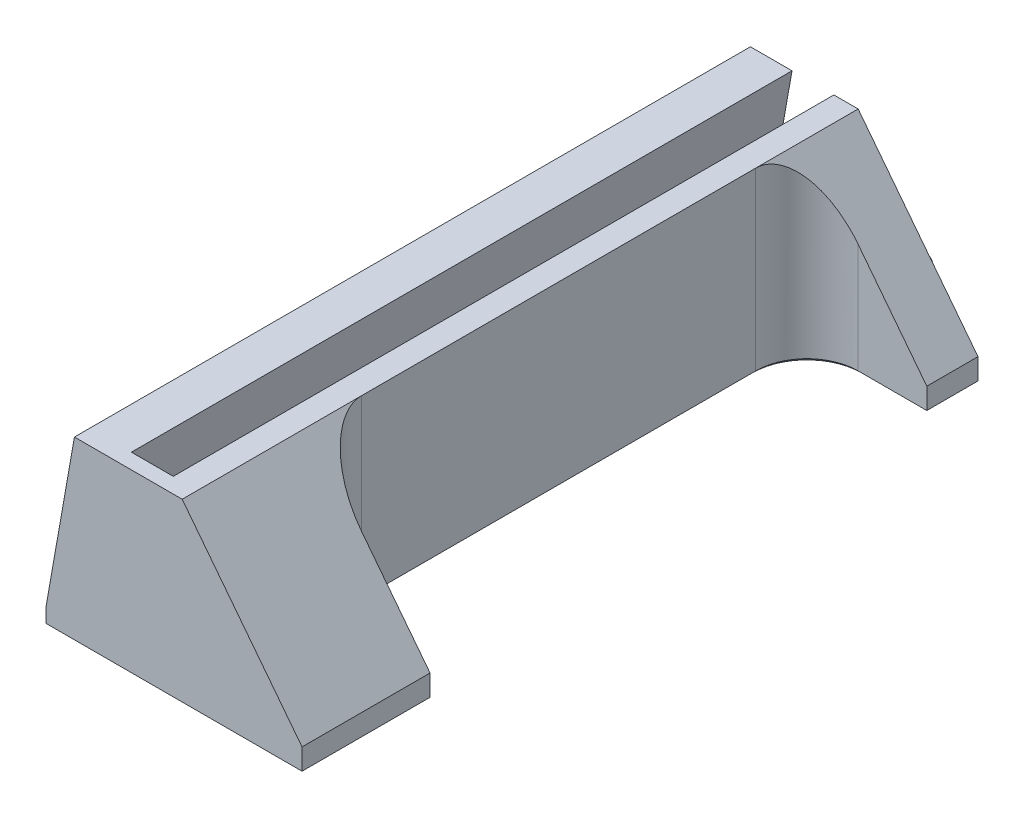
ISO-10303-21;
HEADER;
FILE_DESCRIPTION(('STEP AP214'),'2;1');
FILE_NAME('part.step','',(''),(''),'','','');
FILE_SCHEMA(('AUTOMOTIVE_DESIGN { 1 0 10303 214 1 1 1 1 }'));
ENDSEC;
DATA;
#1=APPLICATION_CONTEXT('core data for automotive mechanical design processes');
#2=APPLICATION_PROTOCOL_DEFINITION('international standard','automotive_design',2000,#1);
#3=PRODUCT_CONTEXT('',#1,'mechanical');
#4=PRODUCT('Part','Part','',(#3));
#5=PRODUCT_RELATED_PRODUCT_CATEGORY('part','',(#4));
#6=PRODUCT_DEFINITION_FORMATION('','',#4);
#7=PRODUCT_DEFINITION_CONTEXT('part definition',#1,'design');
#8=PRODUCT_DEFINITION('design','',#6,#7);
#9=PRODUCT_DEFINITION_SHAPE('','',#8);
#10=(LENGTH_UNIT() NAMED_UNIT(*) SI_UNIT(.MILLI.,.METRE.));
#11=(NAMED_UNIT(*) PLANE_ANGLE_UNIT() SI_UNIT($,.RADIAN.));
#12=(NAMED_UNIT(*) SI_UNIT($,.STERADIAN.) SOLID_ANGLE_UNIT());
#13=UNCERTAINTY_MEASURE_WITH_UNIT(LENGTH_MEASURE(1.E-05),#10,'distance_accuracy_value','');
#14=(GEOMETRIC_REPRESENTATION_CONTEXT(3) GLOBAL_UNCERTAINTY_ASSIGNED_CONTEXT((#13)) GLOBAL_UNIT_ASSIGNED_CONTEXT((#10,
#11,#12)) REPRESENTATION_CONTEXT('',''));
#15=CARTESIAN_POINT('',(0.,0.,0.));
#16=DIRECTION('',(0.,0.,1.));
#17=DIRECTION('',(1.,0.,0.));
#18=AXIS2_PLACEMENT_3D('',#15,#16,#17);
#19=CARTESIAN_POINT('',(-11.3201608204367,15.,132.));
#20=DIRECTION('',(-0.984807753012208,0.17364817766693,0.));
#21=DIRECTION('',(-0.17364817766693,-0.984807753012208,0.));
#22=AXIS2_PLACEMENT_3D('',#19,#20,#21);
#23=PLANE('',#22);
#24=DIRECTION('',(0.,0.,1.));
#25=VECTOR('',#24,1.);
#26=CARTESIAN_POINT('',(-13.2597576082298,4.,132.));
#27=LINE('',#26,#25);
#28=CARTESIAN_POINT('',(-13.2597576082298,4.,123.));
#29=VERTEX_POINT('',#28);
#30=CARTESIAN_POINT('',(-13.2597576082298,4.,129.));
#31=VERTEX_POINT('',#30);
#32=EDGE_CURVE('E554',#29,#31,#27,.T.);
#33=ORIENTED_EDGE('',*,*,#32,.F.);
#34=DIRECTION('',(-0.17364817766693,-0.984807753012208,0.));
#35=VECTOR('',#34,1.);
#36=CARTESIAN_POINT('',(-11.3201608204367,15.,123.));
#37=LINE('',#36,#35);
#38=CARTESIAN_POINT('',(-13.4913594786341,2.68652052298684,123.));
#39=VERTEX_POINT('',#38);
#40=EDGE_CURVE('E592',#29,#39,#37,.T.);
#41=ORIENTED_EDGE('',*,*,#40,.T.);
#42=DIRECTION('',(0.,0.,-1.));
#43=VECTOR('',#42,1.);
#44=CARTESIAN_POINT('',(-13.4913594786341,2.68652052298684,132.));
#45=LINE('',#44,#43);
#46=CARTESIAN_POINT('',(-13.4913594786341,2.68652052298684,0.));
#47=VERTEX_POINT('',#46);
#48=EDGE_CURVE('E677',#39,#47,#45,.T.);
#49=ORIENTED_EDGE('',*,*,#48,.T.);
#50=DIRECTION('',(0.17364817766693,0.984807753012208,0.));
#51=VECTOR('',#50,1.);
#52=CARTESIAN_POINT('',(-11.3201608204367,15.,0.));
#53=LINE('',#52,#51);
#54=CARTESIAN_POINT('',(-11.3201608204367,15.,0.));
#55=VERTEX_POINT('',#54);
#56=EDGE_CURVE('E656',#47,#55,#53,.T.);
#57=ORIENTED_EDGE('',*,*,#56,.T.);
#58=DIRECTION('',(0.,0.,-1.));
#59=VECTOR('',#58,1.);
#60=CARTESIAN_POINT('',(-11.3201608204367,15.,132.));
#61=LINE('',#60,#59);
#62=CARTESIAN_POINT('',(-11.3201608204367,15.,129.));
#63=VERTEX_POINT('',#62);
#64=EDGE_CURVE('E797',#63,#55,#61,.T.);
#65=ORIENTED_EDGE('',*,*,#64,.F.);
#66=DIRECTION('',(0.17364817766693,0.984807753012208,0.));
#67=VECTOR('',#66,1.);
#68=CARTESIAN_POINT('',(-11.3201608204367,15.,129.));
#69=LINE('',#68,#67);
#70=EDGE_CURVE('E604',#31,#63,#69,.T.);
#71=ORIENTED_EDGE('',*,*,#70,.F.);
#72=EDGE_LOOP('',(#33,#41,#49,#57,#65,#71));
#73=FACE_BOUND('',#72,.T.);
#74=ADVANCED_FACE('F43',(#73),#23,.F.);
#75=CARTESIAN_POINT('',(-5.57705108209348,1.21269145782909,132.));
#76=DIRECTION('',(0.984807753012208,-0.17364817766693,0.));
#77=DIRECTION('',(0.17364817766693,0.984807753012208,0.));
#78=AXIS2_PLACEMENT_3D('',#75,#76,#77);
#79=PLANE('',#78);
#80=DIRECTION('',(0.,0.,-1.));
#81=VECTOR('',#80,1.);
#82=CARTESIAN_POINT('',(-5.57705108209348,1.21269145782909,132.));
#83=LINE('',#82,#81);
#84=CARTESIAN_POINT('',(-5.57705108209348,1.21269145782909,123.));
#85=VERTEX_POINT('',#84);
#86=CARTESIAN_POINT('',(-5.57705108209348,1.21269145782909,0.));
#87=VERTEX_POINT('',#86);
#88=EDGE_CURVE('E774',#85,#87,#83,.T.);
#89=ORIENTED_EDGE('',*,*,#88,.F.);
#90=DIRECTION('',(0.17364817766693,0.984807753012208,0.));
#91=VECTOR('',#90,1.);
#92=CARTESIAN_POINT('',(-5.57705108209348,1.21269145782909,123.));
#93=LINE('',#92,#91);
#94=CARTESIAN_POINT('',(-5.08557338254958,4.,123.));
#95=VERTEX_POINT('',#94);
#96=EDGE_CURVE('E588',#85,#95,#93,.T.);
#97=ORIENTED_EDGE('',*,*,#96,.T.);
#98=DIRECTION('',(0.,0.,-1.));
#99=VECTOR('',#98,1.);
#100=CARTESIAN_POINT('',(-5.08557338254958,4.,132.));
#101=LINE('',#100,#99);
#102=CARTESIAN_POINT('',(-5.08557338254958,4.,129.));
#103=VERTEX_POINT('',#102);
#104=EDGE_CURVE('E548',#103,#95,#101,.T.);
#105=ORIENTED_EDGE('',*,*,#104,.F.);
#106=DIRECTION('',(-0.17364817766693,-0.984807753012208,0.));
#107=VECTOR('',#106,1.);
#108=CARTESIAN_POINT('',(-5.57705108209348,1.21269145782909,129.));
#109=LINE('',#108,#107);
#110=CARTESIAN_POINT('',(-3.14597659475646,15.,129.));
#111=VERTEX_POINT('',#110);
#112=EDGE_CURVE('E600',#111,#103,#109,.T.);
#113=ORIENTED_EDGE('',*,*,#112,.F.);
#114=DIRECTION('',(0.,0.,-1.));
#115=VECTOR('',#114,1.);
#116=CARTESIAN_POINT('',(-3.14597659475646,15.,132.));
#117=LINE('',#116,#115);
#118=CARTESIAN_POINT('',(-3.14597659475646,15.,0.));
#119=VERTEX_POINT('',#118);
#120=EDGE_CURVE('E777',#111,#119,#117,.T.);
#121=ORIENTED_EDGE('',*,*,#120,.T.);
#122=DIRECTION('',(-0.17364817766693,-0.984807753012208,0.));
#123=VECTOR('',#122,1.);
#124=CARTESIAN_POINT('',(-5.57705108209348,1.21269145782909,0.));
#125=LINE('',#124,#123);
#126=EDGE_CURVE('E702',#119,#87,#125,.T.);
#127=ORIENTED_EDGE('',*,*,#126,.T.);
#128=EDGE_LOOP('',(#89,#97,#105,#113,#121,#127));
#129=FACE_BOUND('',#128,.T.);
#130=ADVANCED_FACE('F1274',(#129),#79,.F.);
#131=CARTESIAN_POINT('',(-5.57705108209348,1.21269145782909,132.));
#132=DIRECTION('',(-0.17364817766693,-0.984807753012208,0.));
#133=DIRECTION('',(0.984807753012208,-0.17364817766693,0.));
#134=AXIS2_PLACEMENT_3D('',#131,#132,#133);
#135=PLANE('',#134);
#136=DIRECTION('',(0.,0.,-1.));
#137=VECTOR('',#136,1.);
#138=CARTESIAN_POINT('',(-6.56185883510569,1.38633963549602,132.));
#139=LINE('',#138,#137);
#140=CARTESIAN_POINT('',(-6.56185883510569,1.38633963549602,123.));
#141=VERTEX_POINT('',#140);
#142=CARTESIAN_POINT('',(-6.56185883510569,1.38633963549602,0.));
#143=VERTEX_POINT('',#142);
#144=EDGE_CURVE('E771',#141,#143,#139,.T.);
#145=ORIENTED_EDGE('',*,*,#144,.F.);
#146=DIRECTION('',(0.984807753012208,-0.17364817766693,0.));
#147=VECTOR('',#146,1.);
#148=CARTESIAN_POINT('',(-5.57705108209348,1.21269145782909,123.));
#149=LINE('',#148,#147);
#150=EDGE_CURVE('E584',#141,#85,#149,.T.);
#151=ORIENTED_EDGE('',*,*,#150,.T.);
#152=ORIENTED_EDGE('',*,*,#88,.T.);
#153=DIRECTION('',(-0.984807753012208,0.17364817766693,0.));
#154=VECTOR('',#153,1.);
#155=CARTESIAN_POINT('',(-5.57705108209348,1.21269145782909,0.));
#156=LINE('',#155,#154);
#157=EDGE_CURVE('E706',#87,#143,#156,.T.);
#158=ORIENTED_EDGE('',*,*,#157,.T.);
#159=EDGE_LOOP('',(#145,#151,#152,#158));
#160=FACE_BOUND('',#159,.T.);
#161=ADVANCED_FACE('F1280',(#160),#135,.F.);
#162=CARTESIAN_POINT('',(-6.73550701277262,0.401531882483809,132.));
#163=DIRECTION('',(0.984807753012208,-0.173648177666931,0.));
#164=DIRECTION('',(0.173648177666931,0.984807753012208,0.));
#165=AXIS2_PLACEMENT_3D('',#162,#163,#164);
#166=PLANE('',#165);
#167=DIRECTION('',(0.,0.,-1.));
#168=VECTOR('',#167,1.);
#169=CARTESIAN_POINT('',(-6.73550701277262,0.401531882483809,132.));
#170=LINE('',#169,#168);
#171=CARTESIAN_POINT('',(-6.73550701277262,0.401531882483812,123.));
#172=VERTEX_POINT('',#171);
#173=CARTESIAN_POINT('',(-6.73550701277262,0.401531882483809,0.));
#174=VERTEX_POINT('',#173);
#175=EDGE_CURVE('E768',#172,#174,#170,.T.);
#176=ORIENTED_EDGE('',*,*,#175,.F.);
#177=DIRECTION('',(0.173648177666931,0.984807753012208,0.));
#178=VECTOR('',#177,1.);
#179=CARTESIAN_POINT('',(-6.73550701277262,0.401531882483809,123.));
#180=LINE('',#179,#178);
#181=EDGE_CURVE('E580',#172,#141,#180,.T.);
#182=ORIENTED_EDGE('',*,*,#181,.T.);
#183=ORIENTED_EDGE('',*,*,#144,.T.);
#184=DIRECTION('',(-0.173648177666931,-0.984807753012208,0.));
#185=VECTOR('',#184,1.);
#186=CARTESIAN_POINT('',(-6.73550701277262,0.401531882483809,0.));
#187=LINE('',#186,#185);
#188=EDGE_CURVE('E710',#143,#174,#187,.T.);
#189=ORIENTED_EDGE('',*,*,#188,.T.);
#190=EDGE_LOOP('',(#176,#182,#183,#189));
#191=FACE_BOUND('',#190,.T.);
#192=ADVANCED_FACE('F1815',(#191),#166,.F.);
#193=CARTESIAN_POINT('',(-5.75069925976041,0.227883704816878,132.));
#194=DIRECTION('',(0.173648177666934,0.984807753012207,0.));
#195=DIRECTION('',(-0.984807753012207,0.173648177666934,0.));
#196=AXIS2_PLACEMENT_3D('',#193,#194,#195);
#197=PLANE('',#196);
#198=DIRECTION('',(0.,0.,-1.));
#199=VECTOR('',#198,1.);
#200=CARTESIAN_POINT('',(-3.781083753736,-0.119412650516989,132.));
#201=LINE('',#200,#199);
#202=CARTESIAN_POINT('',(-3.781083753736,-0.119412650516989,123.));
#203=VERTEX_POINT('',#202);
#204=CARTESIAN_POINT('',(-3.781083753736,-0.119412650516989,0.));
#205=VERTEX_POINT('',#204);
#206=EDGE_CURVE('E765',#203,#205,#201,.T.);
#207=ORIENTED_EDGE('',*,*,#206,.F.);
#208=DIRECTION('',(-0.984807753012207,0.173648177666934,0.));
#209=VECTOR('',#208,1.);
#210=CARTESIAN_POINT('',(-5.75069925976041,0.227883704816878,123.));
#211=LINE('',#210,#209);
#212=EDGE_CURVE('E576',#203,#172,#211,.T.);
#213=ORIENTED_EDGE('',*,*,#212,.T.);
#214=ORIENTED_EDGE('',*,*,#175,.T.);
#215=DIRECTION('',(0.984807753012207,-0.173648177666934,0.));
#216=VECTOR('',#215,1.);
#217=CARTESIAN_POINT('',(-5.75069925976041,0.227883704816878,0.));
#218=LINE('',#217,#216);
#219=EDGE_CURVE('E714',#174,#205,#218,.T.);
#220=ORIENTED_EDGE('',*,*,#219,.T.);
#221=EDGE_LOOP('',(#207,#213,#214,#220));
#222=FACE_BOUND('',#221,.T.);
#223=ADVANCED_FACE('F1807',(#222),#197,.F.);
#224=CARTESIAN_POINT('',(-3.781083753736,-0.119412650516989,132.));
#225=DIRECTION('',(0.984807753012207,-0.173648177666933,0.));
#226=DIRECTION('',(0.173648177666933,0.984807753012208,0.));
#227=AXIS2_PLACEMENT_3D('',#224,#225,#226);
#228=PLANE('',#227);
#229=DIRECTION('',(0.,0.,-1.));
#230=VECTOR('',#229,1.);
#231=CARTESIAN_POINT('',(-4.12838010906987,-2.0890281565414,132.));
#232=LINE('',#231,#230);
#233=CARTESIAN_POINT('',(-4.12838010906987,-2.0890281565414,121.5));
#234=VERTEX_POINT('',#233);
#235=CARTESIAN_POINT('',(-4.12838010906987,-2.0890281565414,0.));
#236=VERTEX_POINT('',#235);
#237=EDGE_CURVE('E762',#234,#236,#232,.T.);
#238=ORIENTED_EDGE('',*,*,#237,.F.);
#239=CARTESIAN_POINT('',(-4.38885237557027,-3.56623978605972,121.5));
#240=DIRECTION('',(0.984807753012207,-0.173648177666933,0.));
#241=DIRECTION('',(0.173648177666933,0.984807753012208,0.));
#242=AXIS2_PLACEMENT_3D('',#239,#240,#241);
#243=CIRCLE('',#242,1.5);
#244=CARTESIAN_POINT('',(-4.38885237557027,-3.56623978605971,123.));
#245=VERTEX_POINT('',#244);
#246=EDGE_CURVE('E949',#234,#245,#243,.T.);
#247=ORIENTED_EDGE('',*,*,#246,.T.);
#248=DIRECTION('',(0.173648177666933,0.984807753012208,0.));
#249=VECTOR('',#248,1.);
#250=CARTESIAN_POINT('',(-3.781083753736,-0.119412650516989,123.));
#251=LINE('',#250,#249);
#252=EDGE_CURVE('E572',#245,#203,#251,.T.);
#253=ORIENTED_EDGE('',*,*,#252,.T.);
#254=ORIENTED_EDGE('',*,*,#206,.T.);
#255=DIRECTION('',(-0.173648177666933,-0.984807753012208,0.));
#256=VECTOR('',#255,1.);
#257=CARTESIAN_POINT('',(-3.781083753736,-0.119412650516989,0.));
#258=LINE('',#257,#256);
#259=EDGE_CURVE('E718',#205,#236,#258,.T.);
#260=ORIENTED_EDGE('',*,*,#259,.T.);
#261=EDGE_LOOP('',(#238,#247,#253,#254,#260));
#262=FACE_BOUND('',#261,.T.);
#263=ADVANCED_FACE('F1799',(#262),#228,.F.);
#264=CARTESIAN_POINT('',(-15.995313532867,0.00343238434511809,132.));
#265=DIRECTION('',(-0.173648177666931,-0.984807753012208,0.));
#266=DIRECTION('',(0.984807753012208,-0.173648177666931,0.));
#267=AXIS2_PLACEMENT_3D('',#264,#265,#266);
#268=PLANE('',#267);
#269=DIRECTION('',(0.,0.,-1.));
#270=VECTOR('',#269,1.);
#271=CARTESIAN_POINT('',(-15.995313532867,0.00343238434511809,132.));
#272=LINE('',#271,#270);
#273=CARTESIAN_POINT('',(-15.995313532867,0.00343238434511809,121.5));
#274=VERTEX_POINT('',#273);
#275=CARTESIAN_POINT('',(-15.995313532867,0.00343238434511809,0.));
#276=VERTEX_POINT('',#275);
#277=EDGE_CURVE('E759',#274,#276,#272,.T.);
#278=ORIENTED_EDGE('',*,*,#277,.F.);
#279=DIRECTION('',(0.984807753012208,-0.173648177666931,0.));
#280=VECTOR('',#279,1.);
#281=CARTESIAN_POINT('',(-15.995313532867,0.00343238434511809,121.5));
#282=LINE('',#281,#280);
#283=EDGE_CURVE('E941',#274,#234,#282,.T.);
#284=ORIENTED_EDGE('',*,*,#283,.T.);
#285=ORIENTED_EDGE('',*,*,#237,.T.);
#286=DIRECTION('',(-0.984807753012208,0.173648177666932,0.));
#287=VECTOR('',#286,1.);
#288=CARTESIAN_POINT('',(-15.995313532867,0.00343238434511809,0.));
#289=LINE('',#288,#287);
#290=EDGE_CURVE('E722',#236,#276,#289,.T.);
#291=ORIENTED_EDGE('',*,*,#290,.T.);
#292=EDGE_LOOP('',(#278,#284,#285,#291));
#293=FACE_BOUND('',#292,.T.);
#294=ADVANCED_FACE('F1790',(#293),#268,.F.);
#295=CARTESIAN_POINT('',(-15.6465519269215,1.97278896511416,132.));
#296=DIRECTION('',(-0.984678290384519,0.174380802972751,0.));
#297=DIRECTION('',(-0.174380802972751,-0.984678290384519,0.));
#298=AXIS2_PLACEMENT_3D('',#295,#296,#297);
#299=PLANE('',#298);
#300=DIRECTION('',(0.,0.,-1.));
#301=VECTOR('',#300,1.);
#302=CARTESIAN_POINT('',(-15.6465519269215,1.97278896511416,132.));
#303=LINE('',#302,#301);
#304=CARTESIAN_POINT('',(-15.6465519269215,1.97278896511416,123.));
#305=VERTEX_POINT('',#304);
#306=CARTESIAN_POINT('',(-15.6465519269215,1.97278896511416,0.));
#307=VERTEX_POINT('',#306);
#308=EDGE_CURVE('E756',#305,#307,#303,.T.);
#309=ORIENTED_EDGE('',*,*,#308,.F.);
#310=DIRECTION('',(-0.174380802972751,-0.984678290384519,0.));
#311=VECTOR('',#310,1.);
#312=CARTESIAN_POINT('',(-15.6465519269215,1.97278896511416,123.));
#313=LINE('',#312,#311);
#314=CARTESIAN_POINT('',(-16.256884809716,-1.47358545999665,123.));
#315=VERTEX_POINT('',#314);
#316=EDGE_CURVE('E569',#305,#315,#313,.T.);
#317=ORIENTED_EDGE('',*,*,#316,.T.);
#318=CARTESIAN_POINT('',(-16.256884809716,-1.47358545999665,121.5));
#319=DIRECTION('',(-0.984678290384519,0.174380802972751,0.));
#320=DIRECTION('',(0.174380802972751,0.984678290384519,0.));
#321=AXIS2_PLACEMENT_3D('',#318,#319,#320);
#322=ELLIPSE('',#321,1.50000041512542,1.5);
#323=EDGE_CURVE('E953',#315,#274,#322,.T.);
#324=ORIENTED_EDGE('',*,*,#323,.T.);
#325=ORIENTED_EDGE('',*,*,#277,.T.);
#326=DIRECTION('',(0.174380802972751,0.984678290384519,0.));
#327=VECTOR('',#326,1.);
#328=CARTESIAN_POINT('',(-15.6465519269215,1.97278896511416,0.));
#329=LINE('',#328,#327);
#330=EDGE_CURVE('E726',#276,#307,#329,.T.);
#331=ORIENTED_EDGE('',*,*,#330,.T.);
#332=EDGE_LOOP('',(#309,#317,#324,#325,#331));
#333=FACE_BOUND('',#332,.T.);
#334=ADVANCED_FACE('F1781',(#333),#299,.F.);
#335=CARTESIAN_POINT('',(-13.665007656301,1.70171276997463,132.));
#336=DIRECTION('',(0.135538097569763,0.990772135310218,0.));
#337=DIRECTION('',(-0.990772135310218,0.135538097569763,0.));
#338=AXIS2_PLACEMENT_3D('',#335,#336,#337);
#339=PLANE('',#338);
#340=DIRECTION('',(0.,0.,-1.));
#341=VECTOR('',#340,1.);
#342=CARTESIAN_POINT('',(-13.665007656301,1.70171276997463,132.));
#343=LINE('',#342,#341);
#344=CARTESIAN_POINT('',(-13.665007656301,1.70171276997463,123.));
#345=VERTEX_POINT('',#344);
#346=CARTESIAN_POINT('',(-13.665007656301,1.70171276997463,0.));
#347=VERTEX_POINT('',#346);
#348=EDGE_CURVE('E753',#345,#347,#343,.T.);
#349=ORIENTED_EDGE('',*,*,#348,.F.);
#350=DIRECTION('',(-0.990772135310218,0.135538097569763,0.));
#351=VECTOR('',#350,1.);
#352=CARTESIAN_POINT('',(-13.665007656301,1.70171276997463,123.));
#353=LINE('',#352,#351);
#354=EDGE_CURVE('E565',#345,#305,#353,.T.);
#355=ORIENTED_EDGE('',*,*,#354,.T.);
#356=ORIENTED_EDGE('',*,*,#308,.T.);
#357=DIRECTION('',(0.990772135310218,-0.135538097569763,0.));
#358=VECTOR('',#357,1.);
#359=CARTESIAN_POINT('',(-13.665007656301,1.70171276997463,0.));
#360=LINE('',#359,#358);
#361=EDGE_CURVE('E730',#307,#347,#360,.T.);
#362=ORIENTED_EDGE('',*,*,#361,.T.);
#363=EDGE_LOOP('',(#349,#355,#356,#362));
#364=FACE_BOUND('',#363,.T.);
#365=ADVANCED_FACE('F1772',(#364),#339,.F.);
#366=CARTESIAN_POINT('',(-13.665007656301,1.70171276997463,132.));
#367=DIRECTION('',(0.17364817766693,0.984807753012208,0.));
#368=DIRECTION('',(-0.984807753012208,0.17364817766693,0.));
#369=AXIS2_PLACEMENT_3D('',#366,#367,#368);
#370=PLANE('',#369);
#371=DIRECTION('',(0.,0.,-1.));
#372=VECTOR('',#371,1.);
#373=CARTESIAN_POINT('',(-12.6801999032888,1.5280645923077,132.));
#374=LINE('',#373,#372);
#375=CARTESIAN_POINT('',(-12.6801999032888,1.5280645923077,123.));
#376=VERTEX_POINT('',#375);
#377=CARTESIAN_POINT('',(-12.6801999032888,1.5280645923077,0.));
#378=VERTEX_POINT('',#377);
#379=EDGE_CURVE('E750',#376,#378,#374,.T.);
#380=ORIENTED_EDGE('',*,*,#379,.F.);
#381=DIRECTION('',(-0.984807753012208,0.17364817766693,0.));
#382=VECTOR('',#381,1.);
#383=CARTESIAN_POINT('',(-13.665007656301,1.70171276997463,123.));
#384=LINE('',#383,#382);
#385=EDGE_CURVE('E561',#376,#345,#384,.T.);
#386=ORIENTED_EDGE('',*,*,#385,.T.);
#387=ORIENTED_EDGE('',*,*,#348,.T.);
#388=DIRECTION('',(0.984807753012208,-0.17364817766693,0.));
#389=VECTOR('',#388,1.);
#390=CARTESIAN_POINT('',(-13.665007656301,1.70171276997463,0.));
#391=LINE('',#390,#389);
#392=EDGE_CURVE('E734',#347,#378,#391,.T.);
#393=ORIENTED_EDGE('',*,*,#392,.T.);
#394=EDGE_LOOP('',(#380,#386,#387,#393));
#395=FACE_BOUND('',#394,.T.);
#396=ADVANCED_FACE('F1763',(#395),#370,.F.);
#397=CARTESIAN_POINT('',(-12.6801999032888,1.5280645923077,132.));
#398=DIRECTION('',(-0.984807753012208,0.173648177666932,0.));
#399=DIRECTION('',(-0.173648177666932,-0.984807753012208,0.));
#400=AXIS2_PLACEMENT_3D('',#397,#398,#399);
#401=PLANE('',#400);
#402=DIRECTION('',(0.,0.,-1.));
#403=VECTOR('',#402,1.);
#404=CARTESIAN_POINT('',(-12.5065517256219,2.51287234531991,132.));
#405=LINE('',#404,#403);
#406=CARTESIAN_POINT('',(-12.5065517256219,2.51287234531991,123.));
#407=VERTEX_POINT('',#406);
#408=CARTESIAN_POINT('',(-12.5065517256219,2.51287234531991,0.));
#409=VERTEX_POINT('',#408);
#410=EDGE_CURVE('E747',#407,#409,#405,.T.);
#411=ORIENTED_EDGE('',*,*,#410,.F.);
#412=DIRECTION('',(-0.173648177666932,-0.984807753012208,0.));
#413=VECTOR('',#412,1.);
#414=CARTESIAN_POINT('',(-12.6801999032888,1.5280645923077,123.));
#415=LINE('',#414,#413);
#416=EDGE_CURVE('E557',#407,#376,#415,.T.);
#417=ORIENTED_EDGE('',*,*,#416,.T.);
#418=ORIENTED_EDGE('',*,*,#379,.T.);
#419=DIRECTION('',(0.173648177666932,0.984807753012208,0.));
#420=VECTOR('',#419,1.);
#421=CARTESIAN_POINT('',(-12.6801999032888,1.5280645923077,0.));
#422=LINE('',#421,#420);
#423=EDGE_CURVE('E738',#378,#409,#422,.T.);
#424=ORIENTED_EDGE('',*,*,#423,.T.);
#425=EDGE_LOOP('',(#411,#417,#418,#424));
#426=FACE_BOUND('',#425,.T.);
#427=ADVANCED_FACE('F1754',(#426),#401,.F.);
#428=CARTESIAN_POINT('',(-13.4913594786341,2.68652052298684,132.));
#429=DIRECTION('',(-0.17364817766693,-0.984807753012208,0.));
#430=DIRECTION('',(0.984807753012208,-0.17364817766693,0.));
#431=AXIS2_PLACEMENT_3D('',#428,#429,#430);
#432=PLANE('',#431);
#433=ORIENTED_EDGE('',*,*,#48,.F.);
#434=DIRECTION('',(0.984807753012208,-0.17364817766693,0.));
#435=VECTOR('',#434,1.);
#436=CARTESIAN_POINT('',(-13.4913594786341,2.68652052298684,123.));
#437=LINE('',#436,#435);
#438=EDGE_CURVE('E892',#39,#407,#437,.T.);
#439=ORIENTED_EDGE('',*,*,#438,.T.);
#440=ORIENTED_EDGE('',*,*,#410,.T.);
#441=DIRECTION('',(-0.984807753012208,0.17364817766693,0.));
#442=VECTOR('',#441,1.);
#443=CARTESIAN_POINT('',(-13.4913594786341,2.68652052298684,0.));
#444=LINE('',#443,#442);
#445=EDGE_CURVE('E663',#409,#47,#444,.T.);
#446=ORIENTED_EDGE('',*,*,#445,.T.);
#447=EDGE_LOOP('',(#433,#439,#440,#446));
#448=FACE_BOUND('',#447,.T.);
#449=ADVANCED_FACE('F1586',(#448),#432,.F.);
#450=CARTESIAN_POINT('',(25.,-15.1841895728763,132.));
#451=DIRECTION('',(-1.,0.,0.));
#452=DIRECTION('',(0.,0.,1.));
#453=AXIS2_PLACEMENT_3D('',#450,#451,#452);
#454=PLANE('',#453);
#455=DIRECTION('',(0.,1.,0.));
#456=VECTOR('',#455,1.);
#457=CARTESIAN_POINT('',(25.,-20.,10.));
#458=LINE('',#457,#456);
#459=CARTESIAN_POINT('',(25.,-19.3,10.));
#460=VERTEX_POINT('',#459);
#461=CARTESIAN_POINT('',(25.,-15.1841895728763,10.));
#462=VERTEX_POINT('',#461);
#463=EDGE_CURVE('E653',#460,#462,#458,.T.);
#464=ORIENTED_EDGE('',*,*,#463,.F.);
#465=DIRECTION('',(0.,0.,-1.));
#466=VECTOR('',#465,1.);
#467=CARTESIAN_POINT('',(25.,-19.3,132.));
#468=LINE('',#467,#466);
#469=CARTESIAN_POINT('',(25.,-19.3,0.));
#470=VERTEX_POINT('',#469);
#471=EDGE_CURVE('E1049',#460,#470,#468,.T.);
#472=ORIENTED_EDGE('',*,*,#471,.T.);
#473=DIRECTION('',(0.,1.,0.));
#474=VECTOR('',#473,1.);
#475=CARTESIAN_POINT('',(25.,-15.1841895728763,0.));
#476=LINE('',#475,#474);
#477=CARTESIAN_POINT('',(25.,-15.1841895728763,0.));
#478=VERTEX_POINT('',#477);
#479=EDGE_CURVE('E691',#470,#478,#476,.T.);
#480=ORIENTED_EDGE('',*,*,#479,.T.);
#481=DIRECTION('',(0.,0.,-1.));
#482=VECTOR('',#481,1.);
#483=CARTESIAN_POINT('',(25.,-15.1841895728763,132.));
#484=LINE('',#483,#482);
#485=EDGE_CURVE('E784',#462,#478,#484,.T.);
#486=ORIENTED_EDGE('',*,*,#485,.F.);
#487=EDGE_LOOP('',(#464,#472,#480,#486));
#488=FACE_BOUND('',#487,.T.);
#489=ADVANCED_FACE('F1580',(#488),#454,.F.);
#490=CARTESIAN_POINT('',(25.,-15.1841895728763,132.));
#491=DIRECTION('',(-0.790271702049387,-0.612756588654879,0.));
#492=DIRECTION('',(0.612756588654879,-0.790271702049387,0.));
#493=AXIS2_PLACEMENT_3D('',#490,#491,#492);
#494=PLANE('',#493);
#495=DIRECTION('',(0.,0.,-1.));
#496=VECTOR('',#495,1.);
#497=CARTESIAN_POINT('',(1.59594670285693,15.,132.));
#498=LINE('',#497,#496);
#499=CARTESIAN_POINT('',(1.59594670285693,15.,20.));
#500=VERTEX_POINT('',#499);
#501=CARTESIAN_POINT('',(1.59594670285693,15.,0.));
#502=VERTEX_POINT('',#501);
#503=EDGE_CURVE('E780',#500,#502,#498,.T.);
#504=ORIENTED_EDGE('',*,*,#503,.F.);
#505=CARTESIAN_POINT('',(11.5959467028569,2.10300767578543,20.));
#506=DIRECTION('',(-0.790271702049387,-0.612756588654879,0.));
#507=DIRECTION('',(0.612756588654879,-0.790271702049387,0.));
#508=AXIS2_PLACEMENT_3D('',#505,#506,#507);
#509=ELLIPSE('',#508,16.3196939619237,10.);
#510=CARTESIAN_POINT('',(11.5959467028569,2.10300767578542,9.99999999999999));
#511=VERTEX_POINT('',#510);
#512=EDGE_CURVE('E827',#500,#511,#509,.T.);
#513=ORIENTED_EDGE('',*,*,#512,.T.);
#514=DIRECTION('',(0.612756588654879,-0.790271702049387,0.));
#515=VECTOR('',#514,1.);
#516=CARTESIAN_POINT('',(25.,-15.1841895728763,9.99999999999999));
#517=LINE('',#516,#515);
#518=EDGE_CURVE('E804',#511,#462,#517,.T.);
#519=ORIENTED_EDGE('',*,*,#518,.T.);
#520=ORIENTED_EDGE('',*,*,#485,.T.);
#521=DIRECTION('',(-0.612756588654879,0.790271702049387,0.));
#522=VECTOR('',#521,1.);
#523=CARTESIAN_POINT('',(25.,-15.1841895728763,0.));
#524=LINE('',#523,#522);
#525=EDGE_CURVE('E694',#478,#502,#524,.T.);
#526=ORIENTED_EDGE('',*,*,#525,.T.);
#527=EDGE_LOOP('',(#504,#513,#519,#520,#526));
#528=FACE_BOUND('',#527,.T.);
#529=ADVANCED_FACE('F1585',(#528),#494,.F.);
#530=CARTESIAN_POINT('',(-19.4435737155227,15.,132.));
#531=DIRECTION('',(0.984807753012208,-0.173648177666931,0.));
#532=DIRECTION('',(0.173648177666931,0.984807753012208,0.));
#533=AXIS2_PLACEMENT_3D('',#530,#531,#532);
#534=PLANE('',#533);
#535=DIRECTION('',(-0.173648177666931,-0.984807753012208,0.));
#536=VECTOR('',#535,1.);
#537=CARTESIAN_POINT('',(-19.4435737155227,15.,0.));
#538=LINE('',#537,#536);
#539=CARTESIAN_POINT('',(-19.4435737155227,15.,0.));
#540=VERTEX_POINT('',#539);
#541=CARTESIAN_POINT('',(-25.,-16.5120593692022,0.));
#542=VERTEX_POINT('',#541);
#543=EDGE_CURVE('E684',#540,#542,#538,.T.);
#544=ORIENTED_EDGE('',*,*,#543,.T.);
#545=DIRECTION('',(0.,0.,-1.));
#546=VECTOR('',#545,1.);
#547=CARTESIAN_POINT('',(-25.,-16.5120593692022,132.));
#548=LINE('',#547,#546);
#549=CARTESIAN_POINT('',(-25.,-16.5120593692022,132.));
#550=VERTEX_POINT('',#549);
#551=EDGE_CURVE('E789',#550,#542,#548,.T.);
#552=ORIENTED_EDGE('',*,*,#551,.F.);
#553=DIRECTION('',(-0.173648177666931,-0.984807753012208,0.));
#554=VECTOR('',#553,1.);
#555=CARTESIAN_POINT('',(-19.4435737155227,15.,132.));
#556=LINE('',#555,#554);
#557=CARTESIAN_POINT('',(-19.4435737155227,15.,132.));
#558=VERTEX_POINT('',#557);
#559=EDGE_CURVE('E662',#558,#550,#556,.T.);
#560=ORIENTED_EDGE('',*,*,#559,.F.);
#561=DIRECTION('',(0.,0.,-1.));
#562=VECTOR('',#561,1.);
#563=CARTESIAN_POINT('',(-19.4435737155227,15.,132.));
#564=LINE('',#563,#562);
#565=EDGE_CURVE('E793',#558,#540,#564,.T.);
#566=ORIENTED_EDGE('',*,*,#565,.T.);
#567=EDGE_LOOP('',(#544,#552,#560,#566));
#568=FACE_BOUND('',#567,.T.);
#569=ADVANCED_FACE('F1285',(#568),#534,.F.);
#570=CARTESIAN_POINT('',(-25.,-16.5120593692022,132.));
#571=DIRECTION('',(1.,0.,0.));
#572=DIRECTION('',(0.,1.,0.));
#573=AXIS2_PLACEMENT_3D('',#570,#571,#572);
#574=PLANE('',#573);
#575=DIRECTION('',(0.,-1.,0.));
#576=VECTOR('',#575,1.);
#577=CARTESIAN_POINT('',(-25.,-16.5120593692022,0.));
#578=LINE('',#577,#576);
#579=CARTESIAN_POINT('',(-25.,-19.3,0.));
#580=VERTEX_POINT('',#579);
#581=EDGE_CURVE('E687',#542,#580,#578,.T.);
#582=ORIENTED_EDGE('',*,*,#581,.T.);
#583=DIRECTION('',(0.,0.,1.));
#584=VECTOR('',#583,1.);
#585=CARTESIAN_POINT('',(-25.,-19.3,132.));
#586=LINE('',#585,#584);
#587=CARTESIAN_POINT('',(-25.,-19.3,132.));
#588=VERTEX_POINT('',#587);
#589=EDGE_CURVE('E1025',#580,#588,#586,.T.);
#590=ORIENTED_EDGE('',*,*,#589,.T.);
#591=DIRECTION('',(0.,-1.,0.));
#592=VECTOR('',#591,1.);
#593=CARTESIAN_POINT('',(-25.,-16.5120593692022,132.));
#594=LINE('',#593,#592);
#595=EDGE_CURVE('E666',#550,#588,#594,.T.);
#596=ORIENTED_EDGE('',*,*,#595,.F.);
#597=ORIENTED_EDGE('',*,*,#551,.T.);
#598=EDGE_LOOP('',(#582,#590,#596,#597));
#599=FACE_BOUND('',#598,.T.);
#600=ADVANCED_FACE('F1597',(#599),#574,.F.);
#601=CARTESIAN_POINT('',(-25.,-20.,132.));
#602=DIRECTION('',(0.,1.,0.));
#603=DIRECTION('',(0.,0.,1.));
#604=AXIS2_PLACEMENT_3D('',#601,#602,#603);
#605=PLANE('',#604);
#606=CARTESIAN_POINT('',(11.5959467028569,-20.,97.));
#607=DIRECTION('',(0.,1.,0.));
#608=DIRECTION('',(0.,0.,1.));
#609=AXIS2_PLACEMENT_3D('',#606,#607,#608);
#610=CIRCLE('',#609,10.7);
#611=CARTESIAN_POINT('',(0.895946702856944,-20.,97.));
#612=VERTEX_POINT('',#611);
#613=CARTESIAN_POINT('',(11.5959467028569,-20.,107.7));
#614=VERTEX_POINT('',#613);
#615=EDGE_CURVE('E1015',#612,#614,#610,.T.);
#616=ORIENTED_EDGE('',*,*,#615,.T.);
#617=DIRECTION('',(1.,0.,0.));
#618=VECTOR('',#617,1.);
#619=CARTESIAN_POINT('',(-25.,-20.,107.7));
#620=LINE('',#619,#618);
#621=CARTESIAN_POINT('',(24.3,-20.,107.7));
#622=VERTEX_POINT('',#621);
#623=EDGE_CURVE('E1018',#614,#622,#620,.T.);
#624=ORIENTED_EDGE('',*,*,#623,.T.);
#625=DIRECTION('',(0.,0.,1.));
#626=VECTOR('',#625,1.);
#627=CARTESIAN_POINT('',(24.3,-20.,132.));
#628=LINE('',#627,#626);
#629=CARTESIAN_POINT('',(24.3,-20.,109.3));
#630=VERTEX_POINT('',#629);
#631=EDGE_CURVE('E990',#622,#630,#628,.T.);
#632=ORIENTED_EDGE('',*,*,#631,.T.);
#633=DIRECTION('',(-1.,0.,0.));
#634=VECTOR('',#633,1.);
#635=CARTESIAN_POINT('',(-25.,-20.,109.3));
#636=LINE('',#635,#634);
#637=CARTESIAN_POINT('',(-1.70405329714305,-20.,109.3));
#638=VERTEX_POINT('',#637);
#639=EDGE_CURVE('E972',#630,#638,#636,.T.);
#640=ORIENTED_EDGE('',*,*,#639,.T.);
#641=DIRECTION('',(0.,0.,-1.));
#642=VECTOR('',#641,1.);
#643=CARTESIAN_POINT('',(-1.70405329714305,-20.,132.));
#644=LINE('',#643,#642);
#645=CARTESIAN_POINT('',(-1.70405329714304,-20.,10.3));
#646=VERTEX_POINT('',#645);
#647=EDGE_CURVE('E975',#638,#646,#644,.T.);
#648=ORIENTED_EDGE('',*,*,#647,.T.);
#649=DIRECTION('',(-1.,0.,0.));
#650=VECTOR('',#649,1.);
#651=CARTESIAN_POINT('',(-25.,-20.,10.3));
#652=LINE('',#651,#650);
#653=CARTESIAN_POINT('',(-21.7,-20.,10.3));
#654=VERTEX_POINT('',#653);
#655=EDGE_CURVE('E978',#646,#654,#652,.T.);
#656=ORIENTED_EDGE('',*,*,#655,.T.);
#657=DIRECTION('',(0.,0.,1.));
#658=VECTOR('',#657,1.);
#659=CARTESIAN_POINT('',(-21.7,-20.,132.));
#660=LINE('',#659,#658);
#661=CARTESIAN_POINT('',(-21.7,-20.,129.7));
#662=VERTEX_POINT('',#661);
#663=EDGE_CURVE('E981',#654,#662,#660,.T.);
#664=ORIENTED_EDGE('',*,*,#663,.T.);
#665=DIRECTION('',(1.,0.,0.));
#666=VECTOR('',#665,1.);
#667=CARTESIAN_POINT('',(-25.,-20.,129.7));
#668=LINE('',#667,#666);
#669=CARTESIAN_POINT('',(24.3,-20.,129.7));
#670=VERTEX_POINT('',#669);
#671=EDGE_CURVE('E984',#662,#670,#668,.T.);
#672=ORIENTED_EDGE('',*,*,#671,.T.);
#673=DIRECTION('',(0.,0.,1.));
#674=VECTOR('',#673,1.);
#675=CARTESIAN_POINT('',(24.3,-20.,132.));
#676=LINE('',#675,#674);
#677=CARTESIAN_POINT('',(24.3,-20.,131.3));
#678=VERTEX_POINT('',#677);
#679=EDGE_CURVE('E987',#670,#678,#676,.T.);
#680=ORIENTED_EDGE('',*,*,#679,.T.);
#681=DIRECTION('',(-1.,0.,0.));
#682=VECTOR('',#681,1.);
#683=CARTESIAN_POINT('',(-25.,-20.,131.3));
#684=LINE('',#683,#682);
#685=CARTESIAN_POINT('',(-24.3,-20.,131.3));
#686=VERTEX_POINT('',#685);
#687=EDGE_CURVE('E993',#678,#686,#684,.T.);
#688=ORIENTED_EDGE('',*,*,#687,.T.);
#689=DIRECTION('',(0.,0.,-1.));
#690=VECTOR('',#689,1.);
#691=CARTESIAN_POINT('',(-24.3,-20.,132.));
#692=LINE('',#691,#690);
#693=CARTESIAN_POINT('',(-24.3,-20.,0.699999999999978));
#694=VERTEX_POINT('',#693);
#695=EDGE_CURVE('E996',#686,#694,#692,.T.);
#696=ORIENTED_EDGE('',*,*,#695,.T.);
#697=DIRECTION('',(1.,0.,0.));
#698=VECTOR('',#697,1.);
#699=CARTESIAN_POINT('',(-25.,-20.,0.699999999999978));
#700=LINE('',#699,#698);
#701=CARTESIAN_POINT('',(24.3,-20.,0.699999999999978));
#702=VERTEX_POINT('',#701);
#703=EDGE_CURVE('E999',#694,#702,#700,.T.);
#704=ORIENTED_EDGE('',*,*,#703,.T.);
#705=DIRECTION('',(0.,0.,1.));
#706=VECTOR('',#705,1.);
#707=CARTESIAN_POINT('',(24.3,-20.,132.));
#708=LINE('',#707,#706);
#709=CARTESIAN_POINT('',(24.3,-20.,9.30000000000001));
#710=VERTEX_POINT('',#709);
#711=EDGE_CURVE('E1003',#702,#710,#708,.T.);
#712=ORIENTED_EDGE('',*,*,#711,.T.);
#713=DIRECTION('',(-1.,0.,0.));
#714=VECTOR('',#713,1.);
#715=CARTESIAN_POINT('',(-25.,-20.,9.3));
#716=LINE('',#715,#714);
#717=CARTESIAN_POINT('',(11.5959467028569,-20.,9.30000000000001));
#718=VERTEX_POINT('',#717);
#719=EDGE_CURVE('E1006',#710,#718,#716,.T.);
#720=ORIENTED_EDGE('',*,*,#719,.T.);
#721=CARTESIAN_POINT('',(11.5959467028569,-20.,20.));
#722=DIRECTION('',(0.,1.,0.));
#723=DIRECTION('',(0.,0.,1.));
#724=AXIS2_PLACEMENT_3D('',#721,#722,#723);
#725=CIRCLE('',#724,10.7);
#726=CARTESIAN_POINT('',(0.895946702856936,-20.,20.));
#727=VERTEX_POINT('',#726);
#728=EDGE_CURVE('E1009',#718,#727,#725,.T.);
#729=ORIENTED_EDGE('',*,*,#728,.T.);
#730=DIRECTION('',(0.,0.,1.));
#731=VECTOR('',#730,1.);
#732=CARTESIAN_POINT('',(0.895946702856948,-20.,132.));
#733=LINE('',#732,#731);
#734=EDGE_CURVE('E1012',#727,#612,#733,.T.);
#735=ORIENTED_EDGE('',*,*,#734,.T.);
#736=EDGE_LOOP('',(#616,#624,#632,#640,#648,#656,#664,#672,#680,#688,#696,#704,#712,#720,#729,#735));
#737=FACE_BOUND('',#736,.T.);
#738=ADVANCED_FACE('F1602',(#737),#605,.F.);
#739=DIRECTION('',(0.,1.,0.));
#740=VECTOR('',#739,1.);
#741=CARTESIAN_POINT('',(25.,-15.1841895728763,132.));
#742=LINE('',#741,#740);
#743=CARTESIAN_POINT('',(25.,-19.3,132.));
#744=VERTEX_POINT('',#743);
#745=CARTESIAN_POINT('',(25.,-15.1841895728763,132.));
#746=VERTEX_POINT('',#745);
#747=EDGE_CURVE('E670',#744,#746,#742,.T.);
#748=ORIENTED_EDGE('',*,*,#747,.F.);
#749=DIRECTION('',(0.,0.,-1.));
#750=VECTOR('',#749,1.);
#751=CARTESIAN_POINT('',(25.,-19.3,132.));
#752=LINE('',#751,#750);
#753=CARTESIAN_POINT('',(25.,-19.3,107.));
#754=VERTEX_POINT('',#753);
#755=EDGE_CURVE('E1031',#744,#754,#752,.T.);
#756=ORIENTED_EDGE('',*,*,#755,.T.);
#757=DIRECTION('',(0.,1.,0.));
#758=VECTOR('',#757,1.);
#759=CARTESIAN_POINT('',(25.,-20.,107.));
#760=LINE('',#759,#758);
#761=CARTESIAN_POINT('',(25.,-15.1841895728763,107.));
#762=VERTEX_POINT('',#761);
#763=EDGE_CURVE('E652',#754,#762,#760,.T.);
#764=ORIENTED_EDGE('',*,*,#763,.T.);
#765=EDGE_CURVE('E785',#746,#762,#484,.T.);
#766=ORIENTED_EDGE('',*,*,#765,.F.);
#767=EDGE_LOOP('',(#748,#756,#764,#766));
#768=FACE_BOUND('',#767,.T.);
#769=ADVANCED_FACE('F1589',(#768),#454,.F.);
#770=ORIENTED_EDGE('',*,*,#765,.T.);
#771=DIRECTION('',(-0.612756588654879,0.790271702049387,0.));
#772=VECTOR('',#771,1.);
#773=CARTESIAN_POINT('',(25.,-15.1841895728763,107.));
#774=LINE('',#773,#772);
#775=CARTESIAN_POINT('',(11.5959467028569,2.10300767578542,107.));
#776=VERTEX_POINT('',#775);
#777=EDGE_CURVE('E800',#762,#776,#774,.T.);
#778=ORIENTED_EDGE('',*,*,#777,.T.);
#779=CARTESIAN_POINT('',(11.5959467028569,2.10300767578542,97.));
#780=DIRECTION('',(-0.790271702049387,-0.612756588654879,0.));
#781=DIRECTION('',(0.612756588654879,-0.790271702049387,0.));
#782=AXIS2_PLACEMENT_3D('',#779,#780,#781);
#783=ELLIPSE('',#782,16.3196939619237,10.);
#784=CARTESIAN_POINT('',(1.59594670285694,15.,97.));
#785=VERTEX_POINT('',#784);
#786=EDGE_CURVE('E823',#776,#785,#783,.T.);
#787=ORIENTED_EDGE('',*,*,#786,.T.);
#788=CARTESIAN_POINT('',(1.59594670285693,15.,132.));
#789=VERTEX_POINT('',#788);
#790=EDGE_CURVE('E781',#789,#785,#498,.T.);
#791=ORIENTED_EDGE('',*,*,#790,.F.);
#792=DIRECTION('',(-0.612756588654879,0.790271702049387,0.));
#793=VECTOR('',#792,1.);
#794=CARTESIAN_POINT('',(25.,-15.1841895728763,132.));
#795=LINE('',#794,#793);
#796=EDGE_CURVE('E673',#746,#789,#795,.T.);
#797=ORIENTED_EDGE('',*,*,#796,.F.);
#798=EDGE_LOOP('',(#770,#778,#787,#791,#797));
#799=FACE_BOUND('',#798,.T.);
#800=ADVANCED_FACE('F1622',(#799),#494,.F.);
#801=CARTESIAN_POINT('',(-3.14597659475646,15.,132.));
#802=DIRECTION('',(0.,-1.,0.));
#803=DIRECTION('',(0.,0.,-1.));
#804=AXIS2_PLACEMENT_3D('',#801,#802,#803);
#805=PLANE('',#804);
#806=DIRECTION('',(-1.,0.,0.));
#807=VECTOR('',#806,1.);
#808=CARTESIAN_POINT('',(-19.4435737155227,15.,132.));
#809=LINE('',#808,#807);
#810=EDGE_CURVE('E659',#789,#558,#809,.T.);
#811=ORIENTED_EDGE('',*,*,#810,.F.);
#812=ORIENTED_EDGE('',*,*,#790,.T.);
#813=DIRECTION('',(0.,0.,1.));
#814=VECTOR('',#813,1.);
#815=CARTESIAN_POINT('',(1.59594670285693,15.,9.99999999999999));
#816=LINE('',#815,#814);
#817=EDGE_CURVE('E641',#500,#785,#816,.T.);
#818=ORIENTED_EDGE('',*,*,#817,.F.);
#819=ORIENTED_EDGE('',*,*,#503,.T.);
#820=DIRECTION('',(-1.,0.,0.));
#821=VECTOR('',#820,1.);
#822=CARTESIAN_POINT('',(-3.14597659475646,15.,0.));
#823=LINE('',#822,#821);
#824=EDGE_CURVE('E698',#502,#119,#823,.T.);
#825=ORIENTED_EDGE('',*,*,#824,.T.);
#826=ORIENTED_EDGE('',*,*,#120,.F.);
#827=DIRECTION('',(-1.,0.,0.));
#828=VECTOR('',#827,1.);
#829=CARTESIAN_POINT('',(-17.909714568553,15.,129.));
#830=LINE('',#829,#828);
#831=EDGE_CURVE('E596',#111,#63,#830,.T.);
#832=ORIENTED_EDGE('',*,*,#831,.T.);
#833=ORIENTED_EDGE('',*,*,#64,.T.);
#834=DIRECTION('',(-1.,0.,0.));
#835=VECTOR('',#834,1.);
#836=CARTESIAN_POINT('',(-19.4435737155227,15.,0.));
#837=LINE('',#836,#835);
#838=EDGE_CURVE('E681',#55,#540,#837,.T.);
#839=ORIENTED_EDGE('',*,*,#838,.T.);
#840=ORIENTED_EDGE('',*,*,#565,.F.);
#841=EDGE_LOOP('',(#811,#812,#818,#819,#825,#826,#832,#833,#839,#840));
#842=FACE_BOUND('',#841,.T.);
#843=ADVANCED_FACE('F1635',(#842),#805,.F.);
#844=CARTESIAN_POINT('',(0.,0.,132.));
#845=DIRECTION('',(0.,0.,1.));
#846=DIRECTION('',(1.,0.,0.));
#847=AXIS2_PLACEMENT_3D('',#844,#845,#846);
#848=PLANE('',#847);
#849=ORIENTED_EDGE('',*,*,#595,.T.);
#850=DIRECTION('',(1.,0.,0.));
#851=VECTOR('',#850,1.);
#852=CARTESIAN_POINT('',(25.,-19.3,132.));
#853=LINE('',#852,#851);
#854=EDGE_CURVE('E1028',#588,#744,#853,.T.);
#855=ORIENTED_EDGE('',*,*,#854,.T.);
#856=ORIENTED_EDGE('',*,*,#747,.T.);
#857=ORIENTED_EDGE('',*,*,#796,.T.);
#858=ORIENTED_EDGE('',*,*,#810,.T.);
#859=ORIENTED_EDGE('',*,*,#559,.T.);
#860=EDGE_LOOP('',(#849,#855,#856,#857,#858,#859));
#861=FACE_BOUND('',#860,.T.);
#862=ADVANCED_FACE('F1629',(#861),#848,.T.);
#863=CARTESIAN_POINT('',(0.,0.,0.));
#864=DIRECTION('',(0.,0.,1.));
#865=DIRECTION('',(1.,0.,0.));
#866=AXIS2_PLACEMENT_3D('',#863,#864,#865);
#867=PLANE('',#866);
#868=DIRECTION('',(0.,1.,0.));
#869=VECTOR('',#868,1.);
#870=CARTESIAN_POINT('',(13.,-6.00000000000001,0.));
#871=LINE('',#870,#869);
#872=CARTESIAN_POINT('',(13.,-15.5,0.));
#873=VERTEX_POINT('',#872);
#874=CARTESIAN_POINT('',(13.,-7.5,0.));
#875=VERTEX_POINT('',#874);
#876=EDGE_CURVE('E617',#873,#875,#871,.T.);
#877=ORIENTED_EDGE('',*,*,#876,.T.);
#878=CARTESIAN_POINT('',(11.5,-7.50000000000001,0.));
#879=DIRECTION('',(0.,0.,1.));
#880=DIRECTION('',(1.,0.,0.));
#881=AXIS2_PLACEMENT_3D('',#878,#879,#880);
#882=CIRCLE('',#881,1.5);
#883=CARTESIAN_POINT('',(11.5,-6.00000000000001,0.));
#884=VERTEX_POINT('',#883);
#885=EDGE_CURVE('E889',#875,#884,#882,.T.);
#886=ORIENTED_EDGE('',*,*,#885,.T.);
#887=DIRECTION('',(-1.,0.,0.));
#888=VECTOR('',#887,1.);
#889=CARTESIAN_POINT('',(-19.,-6.00000000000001,0.));
#890=LINE('',#889,#888);
#891=CARTESIAN_POINT('',(-17.5,-6.00000000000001,0.));
#892=VERTEX_POINT('',#891);
#893=EDGE_CURVE('E621',#884,#892,#890,.T.);
#894=ORIENTED_EDGE('',*,*,#893,.T.);
#895=CARTESIAN_POINT('',(-17.5,-7.50000000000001,0.));
#896=DIRECTION('',(0.,0.,1.));
#897=DIRECTION('',(1.,0.,0.));
#898=AXIS2_PLACEMENT_3D('',#895,#896,#897);
#899=CIRCLE('',#898,1.5);
#900=CARTESIAN_POINT('',(-19.,-7.50000000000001,0.));
#901=VERTEX_POINT('',#900);
#902=EDGE_CURVE('E883',#892,#901,#899,.T.);
#903=ORIENTED_EDGE('',*,*,#902,.T.);
#904=DIRECTION('',(0.,-1.,0.));
#905=VECTOR('',#904,1.);
#906=CARTESIAN_POINT('',(-19.,-6.00000000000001,0.));
#907=LINE('',#906,#905);
#908=CARTESIAN_POINT('',(-19.,-15.5,0.));
#909=VERTEX_POINT('',#908);
#910=EDGE_CURVE('E608',#901,#909,#907,.T.);
#911=ORIENTED_EDGE('',*,*,#910,.T.);
#912=CARTESIAN_POINT('',(-17.5,-15.5,0.));
#913=DIRECTION('',(0.,0.,1.));
#914=DIRECTION('',(1.,0.,0.));
#915=AXIS2_PLACEMENT_3D('',#912,#913,#914);
#916=CIRCLE('',#915,1.5);
#917=CARTESIAN_POINT('',(-17.5,-17.,0.));
#918=VERTEX_POINT('',#917);
#919=EDGE_CURVE('E880',#909,#918,#916,.T.);
#920=ORIENTED_EDGE('',*,*,#919,.T.);
#921=DIRECTION('',(1.,0.,0.));
#922=VECTOR('',#921,1.);
#923=CARTESIAN_POINT('',(-19.,-17.,0.));
#924=LINE('',#923,#922);
#925=CARTESIAN_POINT('',(11.5,-17.,0.));
#926=VERTEX_POINT('',#925);
#927=EDGE_CURVE('E612',#918,#926,#924,.T.);
#928=ORIENTED_EDGE('',*,*,#927,.T.);
#929=CARTESIAN_POINT('',(11.5,-15.5,0.));
#930=DIRECTION('',(0.,0.,1.));
#931=DIRECTION('',(1.,0.,0.));
#932=AXIS2_PLACEMENT_3D('',#929,#930,#931);
#933=CIRCLE('',#932,1.5);
#934=EDGE_CURVE('E886',#926,#873,#933,.T.);
#935=ORIENTED_EDGE('',*,*,#934,.T.);
#936=EDGE_LOOP('',(#877,#886,#894,#903,#911,#920,#928,#935));
#937=FACE_BOUND('',#936,.T.);
#938=ORIENTED_EDGE('',*,*,#479,.F.);
#939=DIRECTION('',(-1.,0.,0.));
#940=VECTOR('',#939,1.);
#941=CARTESIAN_POINT('',(0.,-19.3,0.));
#942=LINE('',#941,#940);
#943=EDGE_CURVE('E1021',#470,#580,#942,.T.);
#944=ORIENTED_EDGE('',*,*,#943,.T.);
#945=ORIENTED_EDGE('',*,*,#581,.F.);
#946=ORIENTED_EDGE('',*,*,#543,.F.);
#947=ORIENTED_EDGE('',*,*,#838,.F.);
#948=ORIENTED_EDGE('',*,*,#56,.F.);
#949=ORIENTED_EDGE('',*,*,#445,.F.);
#950=ORIENTED_EDGE('',*,*,#423,.F.);
#951=ORIENTED_EDGE('',*,*,#392,.F.);
#952=ORIENTED_EDGE('',*,*,#361,.F.);
#953=ORIENTED_EDGE('',*,*,#330,.F.);
#954=ORIENTED_EDGE('',*,*,#290,.F.);
#955=ORIENTED_EDGE('',*,*,#259,.F.);
#956=ORIENTED_EDGE('',*,*,#219,.F.);
#957=ORIENTED_EDGE('',*,*,#188,.F.);
#958=ORIENTED_EDGE('',*,*,#157,.F.);
#959=ORIENTED_EDGE('',*,*,#126,.F.);
#960=ORIENTED_EDGE('',*,*,#824,.F.);
#961=ORIENTED_EDGE('',*,*,#525,.F.);
#962=EDGE_LOOP('',(#938,#944,#945,#946,#947,#948,#949,#950,#951,#952,#953,#954,#955,#956,#957,
#958,#959,#960,#961));
#963=FACE_BOUND('',#962,.T.);
#964=ADVANCED_FACE('F1634',(#937,#963),#867,.F.);
#965=CARTESIAN_POINT('',(1.59594670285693,-20.,9.99999999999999));
#966=DIRECTION('',(0.,0.,-1.));
#967=DIRECTION('',(-1.,0.,0.));
#968=AXIS2_PLACEMENT_3D('',#965,#966,#967);
#969=PLANE('',#968);
#970=DIRECTION('',(0.,1.,0.));
#971=VECTOR('',#970,1.);
#972=CARTESIAN_POINT('',(11.5959467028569,-20.,10.));
#973=LINE('',#972,#971);
#974=CARTESIAN_POINT('',(11.5959467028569,-19.3,10.));
#975=VERTEX_POINT('',#974);
#976=EDGE_CURVE('E819',#511,#975,#973,.F.);
#977=ORIENTED_EDGE('',*,*,#976,.T.);
#978=DIRECTION('',(1.,0.,0.));
#979=VECTOR('',#978,1.);
#980=CARTESIAN_POINT('',(1.59594670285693,-19.3,9.99999999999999));
#981=LINE('',#980,#979);
#982=EDGE_CURVE('E1046',#975,#460,#981,.T.);
#983=ORIENTED_EDGE('',*,*,#982,.T.);
#984=ORIENTED_EDGE('',*,*,#463,.T.);
#985=ORIENTED_EDGE('',*,*,#518,.F.);
#986=EDGE_LOOP('',(#977,#983,#984,#985));
#987=FACE_BOUND('',#986,.T.);
#988=ADVANCED_FACE('F1649',(#987),#969,.F.);
#989=CARTESIAN_POINT('',(1.59594670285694,-20.,107.));
#990=DIRECTION('',(0.,0.,1.));
#991=DIRECTION('',(1.,0.,0.));
#992=AXIS2_PLACEMENT_3D('',#989,#990,#991);
#993=PLANE('',#992);
#994=ORIENTED_EDGE('',*,*,#763,.F.);
#995=DIRECTION('',(-1.,0.,0.));
#996=VECTOR('',#995,1.);
#997=CARTESIAN_POINT('',(1.59594670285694,-19.3,107.));
#998=LINE('',#997,#996);
#999=CARTESIAN_POINT('',(11.5959467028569,-19.3,107.));
#1000=VERTEX_POINT('',#999);
#1001=EDGE_CURVE('E1034',#754,#1000,#998,.T.);
#1002=ORIENTED_EDGE('',*,*,#1001,.T.);
#1003=DIRECTION('',(0.,1.,0.));
#1004=VECTOR('',#1003,1.);
#1005=CARTESIAN_POINT('',(11.5959467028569,15.,107.));
#1006=LINE('',#1005,#1004);
#1007=CARTESIAN_POINT('',(11.5959467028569,-14.5406148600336,107.));
#1008=VERTEX_POINT('',#1007);
#1009=EDGE_CURVE('E809',#1000,#1008,#1006,.T.);
#1010=ORIENTED_EDGE('',*,*,#1009,.T.);
#1011=DIRECTION('',(1.,0.,0.));
#1012=VECTOR('',#1011,1.);
#1013=CARTESIAN_POINT('',(1.59594670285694,-14.5406148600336,107.));
#1014=LINE('',#1013,#1012);
#1015=CARTESIAN_POINT('',(17.,-14.5406148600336,107.));
#1016=VERTEX_POINT('',#1015);
#1017=EDGE_CURVE('E461',#1008,#1016,#1014,.T.);
#1018=ORIENTED_EDGE('',*,*,#1017,.T.);
#1019=DIRECTION('',(0.,1.,0.));
#1020=VECTOR('',#1019,1.);
#1021=CARTESIAN_POINT('',(17.,-20.,107.));
#1022=LINE('',#1021,#1020);
#1023=CARTESIAN_POINT('',(17.,-8.54061486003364,107.));
#1024=VERTEX_POINT('',#1023);
#1025=EDGE_CURVE('E968',#1016,#1024,#1022,.T.);
#1026=ORIENTED_EDGE('',*,*,#1025,.T.);
#1027=DIRECTION('',(-1.,0.,0.));
#1028=VECTOR('',#1027,1.);
#1029=CARTESIAN_POINT('',(1.59594670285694,-8.54061486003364,107.));
#1030=LINE('',#1029,#1028);
#1031=CARTESIAN_POINT('',(11.5959467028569,-8.54061486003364,107.));
#1032=VERTEX_POINT('',#1031);
#1033=EDGE_CURVE('E496',#1024,#1032,#1030,.T.);
#1034=ORIENTED_EDGE('',*,*,#1033,.T.);
#1035=EDGE_CURVE('E808',#1032,#776,#1006,.T.);
#1036=ORIENTED_EDGE('',*,*,#1035,.T.);
#1037=ORIENTED_EDGE('',*,*,#777,.F.);
#1038=EDGE_LOOP('',(#994,#1002,#1010,#1018,#1026,#1034,#1036,#1037));
#1039=FACE_BOUND('',#1038,.T.);
#1040=ADVANCED_FACE('F1658',(#1039),#993,.F.);
#1041=CARTESIAN_POINT('',(1.59594670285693,-20.,9.99999999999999));
#1042=DIRECTION('',(-1.,0.,0.));
#1043=DIRECTION('',(0.,0.,1.));
#1044=AXIS2_PLACEMENT_3D('',#1041,#1042,#1043);
#1045=PLANE('',#1044);
#1046=DIRECTION('',(0.,1.,0.));
#1047=VECTOR('',#1046,1.);
#1048=CARTESIAN_POINT('',(1.59594670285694,-20.,97.));
#1049=LINE('',#1048,#1047);
#1050=CARTESIAN_POINT('',(1.59594670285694,-19.3,97.));
#1051=VERTEX_POINT('',#1050);
#1052=EDGE_CURVE('E815',#785,#1051,#1049,.F.);
#1053=ORIENTED_EDGE('',*,*,#1052,.T.);
#1054=DIRECTION('',(0.,0.,-1.));
#1055=VECTOR('',#1054,1.);
#1056=CARTESIAN_POINT('',(1.59594670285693,-19.3,9.99999999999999));
#1057=LINE('',#1056,#1055);
#1058=CARTESIAN_POINT('',(1.59594670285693,-19.3,20.));
#1059=VERTEX_POINT('',#1058);
#1060=EDGE_CURVE('E1040',#1051,#1059,#1057,.T.);
#1061=ORIENTED_EDGE('',*,*,#1060,.T.);
#1062=DIRECTION('',(0.,1.,0.));
#1063=VECTOR('',#1062,1.);
#1064=CARTESIAN_POINT('',(1.59594670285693,15.,20.));
#1065=LINE('',#1064,#1063);
#1066=EDGE_CURVE('E812',#1059,#500,#1065,.T.);
#1067=ORIENTED_EDGE('',*,*,#1066,.T.);
#1068=ORIENTED_EDGE('',*,*,#817,.T.);
#1069=EDGE_LOOP('',(#1053,#1061,#1067,#1068));
#1070=FACE_BOUND('',#1069,.T.);
#1071=ADVANCED_FACE('F1290',(#1070),#1045,.F.);
#1072=CARTESIAN_POINT('',(11.5959467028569,-20.,97.));
#1073=DIRECTION('',(0.,-1.,0.));
#1074=DIRECTION('',(0.,0.,-1.));
#1075=AXIS2_PLACEMENT_3D('',#1072,#1073,#1074);
#1076=CYLINDRICAL_SURFACE('',#1075,10.);
#1077=ORIENTED_EDGE('',*,*,#1009,.F.);
#1078=CARTESIAN_POINT('',(11.5959467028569,-19.3,97.));
#1079=DIRECTION('',(0.,1.,0.));
#1080=DIRECTION('',(0.,0.,1.));
#1081=AXIS2_PLACEMENT_3D('',#1078,#1079,#1080);
#1082=CIRCLE('',#1081,10.);
#1083=EDGE_CURVE('E1037',#1000,#1051,#1082,.F.);
#1084=ORIENTED_EDGE('',*,*,#1083,.T.);
#1085=ORIENTED_EDGE('',*,*,#1052,.F.);
#1086=ORIENTED_EDGE('',*,*,#786,.F.);
#1087=ORIENTED_EDGE('',*,*,#1035,.F.);
#1088=CARTESIAN_POINT('',(11.5959467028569,-8.54061486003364,97.));
#1089=DIRECTION('',(0.,1.,0.));
#1090=DIRECTION('',(0.,0.,1.));
#1091=AXIS2_PLACEMENT_3D('',#1088,#1089,#1090);
#1092=CIRCLE('',#1091,10.);
#1093=CARTESIAN_POINT('',(3.00000000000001,-8.54061486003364,102.109765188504));
#1094=VERTEX_POINT('',#1093);
#1095=EDGE_CURVE('E467',#1094,#1032,#1092,.T.);
#1096=ORIENTED_EDGE('',*,*,#1095,.F.);
#1097=DIRECTION('',(0.,-1.,0.));
#1098=VECTOR('',#1097,1.);
#1099=CARTESIAN_POINT('',(3.00000000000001,-20.,102.109765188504));
#1100=LINE('',#1099,#1098);
#1101=CARTESIAN_POINT('',(3.00000000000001,-14.5406148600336,102.109765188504));
#1102=VERTEX_POINT('',#1101);
#1103=EDGE_CURVE('E473',#1102,#1094,#1100,.F.);
#1104=ORIENTED_EDGE('',*,*,#1103,.F.);
#1105=CARTESIAN_POINT('',(11.5959467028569,-14.5406148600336,97.));
#1106=DIRECTION('',(0.,-1.,0.));
#1107=DIRECTION('',(0.,0.,-1.));
#1108=AXIS2_PLACEMENT_3D('',#1105,#1106,#1107);
#1109=CIRCLE('',#1108,10.);
#1110=EDGE_CURVE('E453',#1008,#1102,#1109,.T.);
#1111=ORIENTED_EDGE('',*,*,#1110,.F.);
#1112=EDGE_LOOP('',(#1077,#1084,#1085,#1086,#1087,#1096,#1104,#1111));
#1113=FACE_BOUND('',#1112,.T.);
#1114=ADVANCED_FACE('F481',(#1113),#1076,.F.);
#1115=CARTESIAN_POINT('',(11.5959467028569,-20.,20.));
#1116=DIRECTION('',(0.,-1.,0.));
#1117=DIRECTION('',(0.,0.,-1.));
#1118=AXIS2_PLACEMENT_3D('',#1115,#1116,#1117);
#1119=CYLINDRICAL_SURFACE('',#1118,10.);
#1120=ORIENTED_EDGE('',*,*,#1066,.F.);
#1121=CARTESIAN_POINT('',(11.5959467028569,-19.3,20.));
#1122=DIRECTION('',(0.,1.,0.));
#1123=DIRECTION('',(0.,0.,1.));
#1124=AXIS2_PLACEMENT_3D('',#1121,#1122,#1123);
#1125=CIRCLE('',#1124,10.);
#1126=EDGE_CURVE('E1043',#1059,#975,#1125,.F.);
#1127=ORIENTED_EDGE('',*,*,#1126,.T.);
#1128=ORIENTED_EDGE('',*,*,#976,.F.);
#1129=ORIENTED_EDGE('',*,*,#512,.F.);
#1130=EDGE_LOOP('',(#1120,#1127,#1128,#1129));
#1131=FACE_BOUND('',#1130,.T.);
#1132=ADVANCED_FACE('F1289',(#1131),#1119,.F.);
#1133=CARTESIAN_POINT('',(-21.,-8.,129.));
#1134=DIRECTION('',(-1.,0.,0.));
#1135=DIRECTION('',(0.,0.,1.));
#1136=AXIS2_PLACEMENT_3D('',#1133,#1134,#1135);
#1137=PLANE('',#1136);
#1138=DIRECTION('',(0.,-1.,0.));
#1139=VECTOR('',#1138,1.);
#1140=CARTESIAN_POINT('',(-21.,-8.,129.));
#1141=LINE('',#1140,#1139);
#1142=CARTESIAN_POINT('',(-21.,4.,129.));
#1143=VERTEX_POINT('',#1142);
#1144=CARTESIAN_POINT('',(-21.,-19.3,129.));
#1145=VERTEX_POINT('',#1144);
#1146=EDGE_CURVE('E637',#1143,#1145,#1141,.T.);
#1147=ORIENTED_EDGE('',*,*,#1146,.T.);
#1148=DIRECTION('',(0.,0.,-1.));
#1149=VECTOR('',#1148,1.);
#1150=CARTESIAN_POINT('',(-21.,-19.3,129.));
#1151=LINE('',#1150,#1149);
#1152=CARTESIAN_POINT('',(-21.,-19.3,11.));
#1153=VERTEX_POINT('',#1152);
#1154=EDGE_CURVE('E1056',#1145,#1153,#1151,.T.);
#1155=ORIENTED_EDGE('',*,*,#1154,.T.);
#1156=DIRECTION('',(0.,-1.,0.));
#1157=VECTOR('',#1156,1.);
#1158=CARTESIAN_POINT('',(-21.,-8.,11.));
#1159=LINE('',#1158,#1157);
#1160=CARTESIAN_POINT('',(-21.,-8.,11.));
#1161=VERTEX_POINT('',#1160);
#1162=EDGE_CURVE('E636',#1161,#1153,#1159,.T.);
#1163=ORIENTED_EDGE('',*,*,#1162,.F.);
#1164=DIRECTION('',(0.,0.,-1.));
#1165=VECTOR('',#1164,1.);
#1166=CARTESIAN_POINT('',(-21.,-8.,129.));
#1167=LINE('',#1166,#1165);
#1168=CARTESIAN_POINT('',(-21.,-8.,119.));
#1169=VERTEX_POINT('',#1168);
#1170=EDGE_CURVE('E625',#1169,#1161,#1167,.T.);
#1171=ORIENTED_EDGE('',*,*,#1170,.F.);
#1172=CARTESIAN_POINT('',(-21.,-4.,119.));
#1173=DIRECTION('',(-1.,0.,0.));
#1174=DIRECTION('',(0.,0.,1.));
#1175=AXIS2_PLACEMENT_3D('',#1172,#1173,#1174);
#1176=CIRCLE('',#1175,4.);
#1177=CARTESIAN_POINT('',(-21.,-4.,123.));
#1178=VERTEX_POINT('',#1177);
#1179=EDGE_CURVE('E12',#1169,#1178,#1176,.T.);
#1180=ORIENTED_EDGE('',*,*,#1179,.T.);
#1181=DIRECTION('',(0.,-1.,0.));
#1182=VECTOR('',#1181,1.);
#1183=CARTESIAN_POINT('',(-21.,4.,123.));
#1184=LINE('',#1183,#1182);
#1185=CARTESIAN_POINT('',(-21.,4.,123.));
#1186=VERTEX_POINT('',#1185);
#1187=EDGE_CURVE('E544',#1186,#1178,#1184,.T.);
#1188=ORIENTED_EDGE('',*,*,#1187,.F.);
#1189=DIRECTION('',(0.,0.,-1.));
#1190=VECTOR('',#1189,1.);
#1191=CARTESIAN_POINT('',(-21.,4.,129.));
#1192=LINE('',#1191,#1190);
#1193=EDGE_CURVE('E527',#1143,#1186,#1192,.T.);
#1194=ORIENTED_EDGE('',*,*,#1193,.F.);
#1195=EDGE_LOOP('',(#1147,#1155,#1163,#1171,#1180,#1188,#1194));
#1196=FACE_BOUND('',#1195,.T.);
#1197=ADVANCED_FACE('F1230',(#1196),#1137,.F.);
#1198=CARTESIAN_POINT('',(-21.,-8.,129.));
#1199=DIRECTION('',(0.,0.,1.));
#1200=DIRECTION('',(1.,0.,0.));
#1201=AXIS2_PLACEMENT_3D('',#1198,#1199,#1200);
#1202=PLANE('',#1201);
#1203=DIRECTION('',(0.612756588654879,-0.790271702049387,0.));
#1204=VECTOR('',#1203,1.);
#1205=CARTESIAN_POINT('',(-17.3982796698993,29.7050227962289,129.));
#1206=LINE('',#1205,#1204);
#1207=CARTESIAN_POINT('',(-2.40405329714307,10.3669805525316,129.));
#1208=VERTEX_POINT('',#1207);
#1209=CARTESIAN_POINT('',(20.5989692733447,-19.3,129.));
#1210=VERTEX_POINT('',#1209);
#1211=EDGE_CURVE('E509',#1208,#1210,#1206,.T.);
#1212=ORIENTED_EDGE('',*,*,#1211,.T.);
#1213=DIRECTION('',(-1.,0.,0.));
#1214=VECTOR('',#1213,1.);
#1215=CARTESIAN_POINT('',(-21.,-19.3,129.));
#1216=LINE('',#1215,#1214);
#1217=EDGE_CURVE('E1052',#1210,#1145,#1216,.T.);
#1218=ORIENTED_EDGE('',*,*,#1217,.T.);
#1219=ORIENTED_EDGE('',*,*,#1146,.F.);
#1220=DIRECTION('',(-1.,0.,0.));
#1221=VECTOR('',#1220,1.);
#1222=CARTESIAN_POINT('',(-21.,4.,129.));
#1223=LINE('',#1222,#1221);
#1224=EDGE_CURVE('E540',#31,#1143,#1223,.T.);
#1225=ORIENTED_EDGE('',*,*,#1224,.F.);
#1226=ORIENTED_EDGE('',*,*,#70,.T.);
#1227=ORIENTED_EDGE('',*,*,#831,.F.);
#1228=ORIENTED_EDGE('',*,*,#112,.T.);
#1229=CARTESIAN_POINT('',(-2.40405329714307,4.,129.));
#1230=VERTEX_POINT('',#1229);
#1231=EDGE_CURVE('E541',#1230,#103,#1223,.T.);
#1232=ORIENTED_EDGE('',*,*,#1231,.F.);
#1233=DIRECTION('',(0.,-1.,0.));
#1234=VECTOR('',#1233,1.);
#1235=CARTESIAN_POINT('',(-2.40405329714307,41.331164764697,129.));
#1236=LINE('',#1235,#1234);
#1237=EDGE_CURVE('E518',#1208,#1230,#1236,.T.);
#1238=ORIENTED_EDGE('',*,*,#1237,.F.);
#1239=EDGE_LOOP('',(#1212,#1218,#1219,#1225,#1226,#1227,#1228,#1232,#1238));
#1240=FACE_BOUND('',#1239,.T.);
#1241=ADVANCED_FACE('F1243',(#1240),#1202,.F.);
#1242=CARTESIAN_POINT('',(-2.40405329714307,-8.,129.));
#1243=DIRECTION('',(1.,0.,0.));
#1244=DIRECTION('',(0.,0.,-1.));
#1245=AXIS2_PLACEMENT_3D('',#1242,#1243,#1244);
#1246=PLANE('',#1245);
#1247=DIRECTION('',(0.,-1.,0.));
#1248=VECTOR('',#1247,1.);
#1249=CARTESIAN_POINT('',(-2.40405329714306,-8.,11.));
#1250=LINE('',#1249,#1248);
#1251=CARTESIAN_POINT('',(-2.40405329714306,-8.,11.));
#1252=VERTEX_POINT('',#1251);
#1253=CARTESIAN_POINT('',(-2.40405329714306,-19.3,11.));
#1254=VERTEX_POINT('',#1253);
#1255=EDGE_CURVE('E642',#1252,#1254,#1250,.T.);
#1256=ORIENTED_EDGE('',*,*,#1255,.T.);
#1257=DIRECTION('',(0.,0.,1.));
#1258=VECTOR('',#1257,1.);
#1259=CARTESIAN_POINT('',(-2.40405329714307,-19.3,129.));
#1260=LINE('',#1259,#1258);
#1261=CARTESIAN_POINT('',(-2.40405329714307,-19.3,110.));
#1262=VERTEX_POINT('',#1261);
#1263=EDGE_CURVE('E1062',#1254,#1262,#1260,.T.);
#1264=ORIENTED_EDGE('',*,*,#1263,.T.);
#1265=DIRECTION('',(0.,-1.,0.));
#1266=VECTOR('',#1265,1.);
#1267=CARTESIAN_POINT('',(-2.40405329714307,41.331164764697,110.));
#1268=LINE('',#1267,#1266);
#1269=CARTESIAN_POINT('',(-2.40405329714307,-7.99999999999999,110.));
#1270=VERTEX_POINT('',#1269);
#1271=EDGE_CURVE('E505',#1270,#1262,#1268,.T.);
#1272=ORIENTED_EDGE('',*,*,#1271,.F.);
#1273=DIRECTION('',(0.,0.,1.));
#1274=VECTOR('',#1273,1.);
#1275=CARTESIAN_POINT('',(-2.40405329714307,-8.,129.));
#1276=LINE('',#1275,#1274);
#1277=EDGE_CURVE('E632',#1252,#1270,#1276,.T.);
#1278=ORIENTED_EDGE('',*,*,#1277,.F.);
#1279=EDGE_LOOP('',(#1256,#1264,#1272,#1278));
#1280=FACE_BOUND('',#1279,.T.);
#1281=ADVANCED_FACE('F1264',(#1280),#1246,.F.);
#1282=CARTESIAN_POINT('',(-21.,-8.,11.));
#1283=DIRECTION('',(0.,0.,-1.));
#1284=DIRECTION('',(-1.,0.,0.));
#1285=AXIS2_PLACEMENT_3D('',#1282,#1283,#1284);
#1286=PLANE('',#1285);
#1287=ORIENTED_EDGE('',*,*,#1162,.T.);
#1288=DIRECTION('',(1.,0.,0.));
#1289=VECTOR('',#1288,1.);
#1290=CARTESIAN_POINT('',(-21.,-19.3,11.));
#1291=LINE('',#1290,#1289);
#1292=EDGE_CURVE('E1059',#1153,#1254,#1291,.T.);
#1293=ORIENTED_EDGE('',*,*,#1292,.T.);
#1294=ORIENTED_EDGE('',*,*,#1255,.F.);
#1295=DIRECTION('',(1.,0.,0.));
#1296=VECTOR('',#1295,1.);
#1297=CARTESIAN_POINT('',(-21.,-8.,11.));
#1298=LINE('',#1297,#1296);
#1299=EDGE_CURVE('E628',#1161,#1252,#1298,.T.);
#1300=ORIENTED_EDGE('',*,*,#1299,.F.);
#1301=EDGE_LOOP('',(#1287,#1293,#1294,#1300));
#1302=FACE_BOUND('',#1301,.T.);
#1303=ADVANCED_FACE('F1262',(#1302),#1286,.F.);
#1304=CARTESIAN_POINT('',(0.,-8.,0.));
#1305=DIRECTION('',(0.,-1.,0.));
#1306=DIRECTION('',(0.,0.,-1.));
#1307=AXIS2_PLACEMENT_3D('',#1304,#1305,#1306);
#1308=PLANE('',#1307);
#1309=DIRECTION('',(0.,0.,-1.));
#1310=VECTOR('',#1309,1.);
#1311=CARTESIAN_POINT('',(-2.40405329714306,-8.,0.));
#1312=LINE('',#1311,#1310);
#1313=CARTESIAN_POINT('',(-2.40405329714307,-8.,119.));
#1314=VERTEX_POINT('',#1313);
#1315=EDGE_CURVE('E517',#1314,#1270,#1312,.T.);
#1316=ORIENTED_EDGE('',*,*,#1315,.F.);
#1317=DIRECTION('',(1.,0.,0.));
#1318=VECTOR('',#1317,1.);
#1319=CARTESIAN_POINT('',(-21.,-8.,119.));
#1320=LINE('',#1319,#1318);
#1321=EDGE_CURVE('E52',#1314,#1169,#1320,.F.);
#1322=ORIENTED_EDGE('',*,*,#1321,.T.);
#1323=ORIENTED_EDGE('',*,*,#1170,.T.);
#1324=ORIENTED_EDGE('',*,*,#1299,.T.);
#1325=ORIENTED_EDGE('',*,*,#1277,.T.);
#1326=EDGE_LOOP('',(#1316,#1322,#1323,#1324,#1325));
#1327=FACE_BOUND('',#1326,.T.);
#1328=ADVANCED_FACE('F1225',(#1327),#1308,.T.);
#1329=CARTESIAN_POINT('',(-19.,-6.00000000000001,-4.));
#1330=DIRECTION('',(-1.,0.,0.));
#1331=DIRECTION('',(0.,0.,1.));
#1332=AXIS2_PLACEMENT_3D('',#1329,#1330,#1331);
#1333=PLANE('',#1332);
#1334=DIRECTION('',(0.,-1.,0.));
#1335=VECTOR('',#1334,1.);
#1336=CARTESIAN_POINT('',(-19.,-17.,-2.5));
#1337=LINE('',#1336,#1335);
#1338=CARTESIAN_POINT('',(-19.,-7.50000000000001,-2.5));
#1339=VERTEX_POINT('',#1338);
#1340=CARTESIAN_POINT('',(-19.,-15.5,-2.5));
#1341=VERTEX_POINT('',#1340);
#1342=EDGE_CURVE('E830',#1339,#1341,#1337,.T.);
#1343=ORIENTED_EDGE('',*,*,#1342,.T.);
#1344=DIRECTION('',(0.,0.,1.));
#1345=VECTOR('',#1344,1.);
#1346=CARTESIAN_POINT('',(-19.,-15.5,-4.));
#1347=LINE('',#1346,#1345);
#1348=EDGE_CURVE('E836',#1341,#909,#1347,.T.);
#1349=ORIENTED_EDGE('',*,*,#1348,.T.);
#1350=ORIENTED_EDGE('',*,*,#910,.F.);
#1351=DIRECTION('',(0.,0.,1.));
#1352=VECTOR('',#1351,1.);
#1353=CARTESIAN_POINT('',(-19.,-7.50000000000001,-4.));
#1354=LINE('',#1353,#1352);
#1355=EDGE_CURVE('E833',#901,#1339,#1354,.F.);
#1356=ORIENTED_EDGE('',*,*,#1355,.T.);
#1357=EDGE_LOOP('',(#1343,#1349,#1350,#1356));
#1358=FACE_BOUND('',#1357,.T.);
#1359=ADVANCED_FACE('F1433',(#1358),#1333,.T.);
#1360=CARTESIAN_POINT('',(-19.,-6.00000000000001,-4.));
#1361=DIRECTION('',(0.,1.,0.));
#1362=DIRECTION('',(0.,0.,1.));
#1363=AXIS2_PLACEMENT_3D('',#1360,#1361,#1362);
#1364=PLANE('',#1363);
#1365=DIRECTION('',(-1.,0.,0.));
#1366=VECTOR('',#1365,1.);
#1367=CARTESIAN_POINT('',(-19.,-6.00000000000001,-2.5));
#1368=LINE('',#1367,#1366);
#1369=CARTESIAN_POINT('',(11.5,-6.00000000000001,-2.5));
#1370=VERTEX_POINT('',#1369);
#1371=CARTESIAN_POINT('',(-17.5,-6.00000000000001,-2.5));
#1372=VERTEX_POINT('',#1371);
#1373=EDGE_CURVE('E849',#1370,#1372,#1368,.T.);
#1374=ORIENTED_EDGE('',*,*,#1373,.T.);
#1375=DIRECTION('',(0.,0.,1.));
#1376=VECTOR('',#1375,1.);
#1377=CARTESIAN_POINT('',(-17.5,-6.00000000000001,-4.));
#1378=LINE('',#1377,#1376);
#1379=EDGE_CURVE('E855',#1372,#892,#1378,.T.);
#1380=ORIENTED_EDGE('',*,*,#1379,.T.);
#1381=ORIENTED_EDGE('',*,*,#893,.F.);
#1382=DIRECTION('',(0.,0.,1.));
#1383=VECTOR('',#1382,1.);
#1384=CARTESIAN_POINT('',(11.5,-6.00000000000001,-4.));
#1385=LINE('',#1384,#1383);
#1386=EDGE_CURVE('E852',#884,#1370,#1385,.F.);
#1387=ORIENTED_EDGE('',*,*,#1386,.T.);
#1388=EDGE_LOOP('',(#1374,#1380,#1381,#1387));
#1389=FACE_BOUND('',#1388,.T.);
#1390=ADVANCED_FACE('F1429',(#1389),#1364,.T.);
#1391=CARTESIAN_POINT('',(13.,-6.00000000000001,-4.));
#1392=DIRECTION('',(1.,0.,0.));
#1393=DIRECTION('',(0.,1.,0.));
#1394=AXIS2_PLACEMENT_3D('',#1391,#1392,#1393);
#1395=PLANE('',#1394);
#1396=ORIENTED_EDGE('',*,*,#876,.F.);
#1397=DIRECTION('',(0.,0.,1.));
#1398=VECTOR('',#1397,1.);
#1399=CARTESIAN_POINT('',(13.,-15.5,-4.));
#1400=LINE('',#1399,#1398);
#1401=CARTESIAN_POINT('',(13.,-15.5,-2.5));
#1402=VERTEX_POINT('',#1401);
#1403=EDGE_CURVE('E864',#873,#1402,#1400,.F.);
#1404=ORIENTED_EDGE('',*,*,#1403,.T.);
#1405=DIRECTION('',(0.,1.,0.));
#1406=VECTOR('',#1405,1.);
#1407=CARTESIAN_POINT('',(13.,-6.00000000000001,-2.5));
#1408=LINE('',#1407,#1406);
#1409=CARTESIAN_POINT('',(13.,-7.5,-2.5));
#1410=VERTEX_POINT('',#1409);
#1411=EDGE_CURVE('E858',#1402,#1410,#1408,.T.);
#1412=ORIENTED_EDGE('',*,*,#1411,.T.);
#1413=DIRECTION('',(0.,0.,1.));
#1414=VECTOR('',#1413,1.);
#1415=CARTESIAN_POINT('',(13.,-7.5,-4.));
#1416=LINE('',#1415,#1414);
#1417=EDGE_CURVE('E861',#1410,#875,#1416,.T.);
#1418=ORIENTED_EDGE('',*,*,#1417,.T.);
#1419=EDGE_LOOP('',(#1396,#1404,#1412,#1418));
#1420=FACE_BOUND('',#1419,.T.);
#1421=ADVANCED_FACE('F1432',(#1420),#1395,.T.);
#1422=CARTESIAN_POINT('',(-19.,-17.,-4.));
#1423=DIRECTION('',(0.,-1.,0.));
#1424=DIRECTION('',(0.,0.,-1.));
#1425=AXIS2_PLACEMENT_3D('',#1422,#1423,#1424);
#1426=PLANE('',#1425);
#1427=ORIENTED_EDGE('',*,*,#927,.F.);
#1428=DIRECTION('',(0.,0.,1.));
#1429=VECTOR('',#1428,1.);
#1430=CARTESIAN_POINT('',(-17.5,-17.,-4.));
#1431=LINE('',#1430,#1429);
#1432=CARTESIAN_POINT('',(-17.5,-17.,-2.5));
#1433=VERTEX_POINT('',#1432);
#1434=EDGE_CURVE('E846',#918,#1433,#1431,.F.);
#1435=ORIENTED_EDGE('',*,*,#1434,.T.);
#1436=DIRECTION('',(1.,0.,0.));
#1437=VECTOR('',#1436,1.);
#1438=CARTESIAN_POINT('',(13.,-17.,-2.5));
#1439=LINE('',#1438,#1437);
#1440=CARTESIAN_POINT('',(11.5,-17.,-2.5));
#1441=VERTEX_POINT('',#1440);
#1442=EDGE_CURVE('E840',#1433,#1441,#1439,.T.);
#1443=ORIENTED_EDGE('',*,*,#1442,.T.);
#1444=DIRECTION('',(0.,0.,1.));
#1445=VECTOR('',#1444,1.);
#1446=CARTESIAN_POINT('',(11.5,-17.,-4.));
#1447=LINE('',#1446,#1445);
#1448=EDGE_CURVE('E843',#1441,#926,#1447,.T.);
#1449=ORIENTED_EDGE('',*,*,#1448,.T.);
#1450=EDGE_LOOP('',(#1427,#1435,#1443,#1449));
#1451=FACE_BOUND('',#1450,.T.);
#1452=ADVANCED_FACE('F1427',(#1451),#1426,.T.);
#1453=CARTESIAN_POINT('',(0.,0.,-4.));
#1454=DIRECTION('',(0.,0.,1.));
#1455=DIRECTION('',(1.,0.,0.));
#1456=AXIS2_PLACEMENT_3D('',#1453,#1454,#1455);
#1457=PLANE('',#1456);
#1458=DIRECTION('',(1.,0.,0.));
#1459=VECTOR('',#1458,1.);
#1460=CARTESIAN_POINT('',(-19.,-15.5,-4.));
#1461=LINE('',#1460,#1459);
#1462=CARTESIAN_POINT('',(11.5,-15.5,-4.));
#1463=VERTEX_POINT('',#1462);
#1464=CARTESIAN_POINT('',(-17.5,-15.5,-4.));
#1465=VERTEX_POINT('',#1464);
#1466=EDGE_CURVE('E873',#1463,#1465,#1461,.F.);
#1467=ORIENTED_EDGE('',*,*,#1466,.T.);
#1468=DIRECTION('',(0.,-1.,0.));
#1469=VECTOR('',#1468,1.);
#1470=CARTESIAN_POINT('',(-17.5,-6.00000000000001,-4.));
#1471=LINE('',#1470,#1469);
#1472=CARTESIAN_POINT('',(-17.5,-7.50000000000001,-4.));
#1473=VERTEX_POINT('',#1472);
#1474=EDGE_CURVE('E876',#1465,#1473,#1471,.F.);
#1475=ORIENTED_EDGE('',*,*,#1474,.T.);
#1476=DIRECTION('',(-1.,0.,0.));
#1477=VECTOR('',#1476,1.);
#1478=CARTESIAN_POINT('',(13.,-7.50000000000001,-4.));
#1479=LINE('',#1478,#1477);
#1480=CARTESIAN_POINT('',(11.5,-7.50000000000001,-4.));
#1481=VERTEX_POINT('',#1480);
#1482=EDGE_CURVE('E867',#1473,#1481,#1479,.F.);
#1483=ORIENTED_EDGE('',*,*,#1482,.T.);
#1484=DIRECTION('',(0.,1.,0.));
#1485=VECTOR('',#1484,1.);
#1486=CARTESIAN_POINT('',(11.5,-17.,-4.));
#1487=LINE('',#1486,#1485);
#1488=EDGE_CURVE('E870',#1481,#1463,#1487,.F.);
#1489=ORIENTED_EDGE('',*,*,#1488,.T.);
#1490=EDGE_LOOP('',(#1467,#1475,#1483,#1489));
#1491=FACE_BOUND('',#1490,.T.);
#1492=ADVANCED_FACE('F1341',(#1491),#1457,.F.);
#1493=CARTESIAN_POINT('',(11.5,-7.50000000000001,-4.));
#1494=DIRECTION('',(0.,0.,1.));
#1495=DIRECTION('',(1.,0.,0.));
#1496=AXIS2_PLACEMENT_3D('',#1493,#1494,#1495);
#1497=CYLINDRICAL_SURFACE('',#1496,1.5);
#1498=CARTESIAN_POINT('',(11.5,-7.50000000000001,-2.5));
#1499=DIRECTION('',(0.,0.,-1.));
#1500=DIRECTION('',(-1.,0.,0.));
#1501=AXIS2_PLACEMENT_3D('',#1498,#1499,#1500);
#1502=CIRCLE('',#1501,1.5);
#1503=EDGE_CURVE('E613',#1370,#1410,#1502,.T.);
#1504=ORIENTED_EDGE('',*,*,#1503,.F.);
#1505=ORIENTED_EDGE('',*,*,#1386,.F.);
#1506=ORIENTED_EDGE('',*,*,#885,.F.);
#1507=ORIENTED_EDGE('',*,*,#1417,.F.);
#1508=EDGE_LOOP('',(#1504,#1505,#1506,#1507));
#1509=FACE_BOUND('',#1508,.T.);
#1510=ADVANCED_FACE('F1337',(#1509),#1497,.T.);
#1511=CARTESIAN_POINT('',(11.5,-7.50000000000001,-2.5));
#1512=DIRECTION('',(0.,0.,1.));
#1513=DIRECTION('',(1.,0.,0.));
#1514=AXIS2_PLACEMENT_3D('',#1511,#1512,#1513);
#1515=SPHERICAL_SURFACE('',#1514,1.5);
#1516=CARTESIAN_POINT('',(11.5,-7.50000000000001,-2.5));
#1517=DIRECTION('',(1.,0.,0.));
#1518=DIRECTION('',(0.,0.,-1.));
#1519=AXIS2_PLACEMENT_3D('',#1516,#1517,#1518);
#1520=CIRCLE('',#1519,1.5);
#1521=EDGE_CURVE('E927',#1370,#1481,#1520,.F.);
#1522=ORIENTED_EDGE('',*,*,#1521,.F.);
#1523=ORIENTED_EDGE('',*,*,#1503,.T.);
#1524=CARTESIAN_POINT('',(11.5,-7.50000000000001,-2.5));
#1525=DIRECTION('',(0.,1.,0.));
#1526=DIRECTION('',(-1.,0.,0.));
#1527=AXIS2_PLACEMENT_3D('',#1524,#1525,#1526);
#1528=CIRCLE('',#1527,1.5);
#1529=EDGE_CURVE('E931',#1481,#1410,#1528,.F.);
#1530=ORIENTED_EDGE('',*,*,#1529,.F.);
#1531=EDGE_LOOP('',(#1522,#1523,#1530));
#1532=FACE_BOUND('',#1531,.T.);
#1533=ADVANCED_FACE('F1333',(#1532),#1515,.T.);
#1534=CARTESIAN_POINT('',(11.5,-15.5,-4.));
#1535=DIRECTION('',(0.,0.,1.));
#1536=DIRECTION('',(1.,0.,0.));
#1537=AXIS2_PLACEMENT_3D('',#1534,#1535,#1536);
#1538=CYLINDRICAL_SURFACE('',#1537,1.5);
#1539=ORIENTED_EDGE('',*,*,#934,.F.);
#1540=ORIENTED_EDGE('',*,*,#1448,.F.);
#1541=CARTESIAN_POINT('',(11.5,-15.5,-2.5));
#1542=DIRECTION('',(0.,0.,-1.));
#1543=DIRECTION('',(-1.,0.,0.));
#1544=AXIS2_PLACEMENT_3D('',#1541,#1542,#1543);
#1545=CIRCLE('',#1544,1.5);
#1546=EDGE_CURVE('E923',#1402,#1441,#1545,.T.);
#1547=ORIENTED_EDGE('',*,*,#1546,.F.);
#1548=ORIENTED_EDGE('',*,*,#1403,.F.);
#1549=EDGE_LOOP('',(#1539,#1540,#1547,#1548));
#1550=FACE_BOUND('',#1549,.T.);
#1551=ADVANCED_FACE('F1329',(#1550),#1538,.T.);
#1552=CARTESIAN_POINT('',(11.5,-6.00000000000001,-2.5));
#1553=DIRECTION('',(0.,-1.,0.));
#1554=DIRECTION('',(1.,0.,0.));
#1555=AXIS2_PLACEMENT_3D('',#1552,#1553,#1554);
#1556=CYLINDRICAL_SURFACE('',#1555,1.5);
#1557=ORIENTED_EDGE('',*,*,#1529,.T.);
#1558=ORIENTED_EDGE('',*,*,#1411,.F.);
#1559=CARTESIAN_POINT('',(11.5,-15.5,-2.5));
#1560=DIRECTION('',(0.,-1.,0.));
#1561=DIRECTION('',(0.,0.,-1.));
#1562=AXIS2_PLACEMENT_3D('',#1559,#1560,#1561);
#1563=CIRCLE('',#1562,1.5);
#1564=EDGE_CURVE('E919',#1463,#1402,#1563,.T.);
#1565=ORIENTED_EDGE('',*,*,#1564,.F.);
#1566=ORIENTED_EDGE('',*,*,#1488,.F.);
#1567=EDGE_LOOP('',(#1557,#1558,#1565,#1566));
#1568=FACE_BOUND('',#1567,.T.);
#1569=ADVANCED_FACE('F1325',(#1568),#1556,.T.);
#1570=CARTESIAN_POINT('',(-19.,-7.50000000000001,-2.5));
#1571=DIRECTION('',(1.,0.,0.));
#1572=DIRECTION('',(0.,0.,-1.));
#1573=AXIS2_PLACEMENT_3D('',#1570,#1571,#1572);
#1574=CYLINDRICAL_SURFACE('',#1573,1.5);
#1575=ORIENTED_EDGE('',*,*,#1521,.T.);
#1576=ORIENTED_EDGE('',*,*,#1482,.F.);
#1577=CARTESIAN_POINT('',(-17.5,-7.50000000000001,-2.5));
#1578=DIRECTION('',(-1.,0.,0.));
#1579=DIRECTION('',(0.,0.,1.));
#1580=AXIS2_PLACEMENT_3D('',#1577,#1578,#1579);
#1581=CIRCLE('',#1580,1.5);
#1582=EDGE_CURVE('E915',#1372,#1473,#1581,.T.);
#1583=ORIENTED_EDGE('',*,*,#1582,.F.);
#1584=ORIENTED_EDGE('',*,*,#1373,.F.);
#1585=EDGE_LOOP('',(#1575,#1576,#1583,#1584));
#1586=FACE_BOUND('',#1585,.T.);
#1587=ADVANCED_FACE('F1321',(#1586),#1574,.T.);
#1588=CARTESIAN_POINT('',(-17.5,-7.50000000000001,-4.));
#1589=DIRECTION('',(0.,0.,1.));
#1590=DIRECTION('',(1.,0.,0.));
#1591=AXIS2_PLACEMENT_3D('',#1588,#1589,#1590);
#1592=CYLINDRICAL_SURFACE('',#1591,1.5);
#1593=ORIENTED_EDGE('',*,*,#902,.F.);
#1594=ORIENTED_EDGE('',*,*,#1379,.F.);
#1595=CARTESIAN_POINT('',(-17.5,-7.50000000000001,-2.5));
#1596=DIRECTION('',(0.,0.,-1.));
#1597=DIRECTION('',(-1.,0.,0.));
#1598=AXIS2_PLACEMENT_3D('',#1595,#1596,#1597);
#1599=CIRCLE('',#1598,1.5);
#1600=EDGE_CURVE('E911',#1339,#1372,#1599,.T.);
#1601=ORIENTED_EDGE('',*,*,#1600,.F.);
#1602=ORIENTED_EDGE('',*,*,#1355,.F.);
#1603=EDGE_LOOP('',(#1593,#1594,#1601,#1602));
#1604=FACE_BOUND('',#1603,.T.);
#1605=ADVANCED_FACE('F1317',(#1604),#1592,.T.);
#1606=CARTESIAN_POINT('',(11.5,-15.5,-2.5));
#1607=DIRECTION('',(0.,0.,1.));
#1608=DIRECTION('',(1.,0.,0.));
#1609=AXIS2_PLACEMENT_3D('',#1606,#1607,#1608);
#1610=SPHERICAL_SURFACE('',#1609,1.5);
#1611=ORIENTED_EDGE('',*,*,#1564,.T.);
#1612=ORIENTED_EDGE('',*,*,#1546,.T.);
#1613=CARTESIAN_POINT('',(11.5,-15.5,-2.5));
#1614=DIRECTION('',(1.,0.,0.));
#1615=DIRECTION('',(0.,0.,-1.));
#1616=AXIS2_PLACEMENT_3D('',#1613,#1614,#1615);
#1617=CIRCLE('',#1616,1.5);
#1618=EDGE_CURVE('E907',#1463,#1441,#1617,.F.);
#1619=ORIENTED_EDGE('',*,*,#1618,.F.);
#1620=EDGE_LOOP('',(#1611,#1612,#1619));
#1621=FACE_BOUND('',#1620,.T.);
#1622=ADVANCED_FACE('F1313',(#1621),#1610,.T.);
#1623=CARTESIAN_POINT('',(-17.5,-7.50000000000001,-2.5));
#1624=DIRECTION('',(0.,0.,1.));
#1625=DIRECTION('',(1.,0.,0.));
#1626=AXIS2_PLACEMENT_3D('',#1623,#1624,#1625);
#1627=SPHERICAL_SURFACE('',#1626,1.5);
#1628=ORIENTED_EDGE('',*,*,#1600,.T.);
#1629=ORIENTED_EDGE('',*,*,#1582,.T.);
#1630=CARTESIAN_POINT('',(-17.5,-7.50000000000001,-2.5));
#1631=DIRECTION('',(0.,1.,0.));
#1632=DIRECTION('',(0.,0.,1.));
#1633=AXIS2_PLACEMENT_3D('',#1630,#1631,#1632);
#1634=CIRCLE('',#1633,1.5);
#1635=EDGE_CURVE('E904',#1339,#1473,#1634,.F.);
#1636=ORIENTED_EDGE('',*,*,#1635,.F.);
#1637=EDGE_LOOP('',(#1628,#1629,#1636));
#1638=FACE_BOUND('',#1637,.T.);
#1639=ADVANCED_FACE('F1309',(#1638),#1627,.T.);
#1640=CARTESIAN_POINT('',(-19.,-15.5,-2.5));
#1641=DIRECTION('',(-1.,0.,0.));
#1642=DIRECTION('',(0.,0.,1.));
#1643=AXIS2_PLACEMENT_3D('',#1640,#1641,#1642);
#1644=CYLINDRICAL_SURFACE('',#1643,1.5);
#1645=ORIENTED_EDGE('',*,*,#1618,.T.);
#1646=ORIENTED_EDGE('',*,*,#1442,.F.);
#1647=CARTESIAN_POINT('',(-17.5,-15.5,-2.5));
#1648=DIRECTION('',(-1.,0.,0.));
#1649=DIRECTION('',(0.,0.,1.));
#1650=AXIS2_PLACEMENT_3D('',#1647,#1648,#1649);
#1651=CIRCLE('',#1650,1.5);
#1652=EDGE_CURVE('E900',#1465,#1433,#1651,.T.);
#1653=ORIENTED_EDGE('',*,*,#1652,.F.);
#1654=ORIENTED_EDGE('',*,*,#1466,.F.);
#1655=EDGE_LOOP('',(#1645,#1646,#1653,#1654));
#1656=FACE_BOUND('',#1655,.T.);
#1657=ADVANCED_FACE('F1305',(#1656),#1644,.T.);
#1658=CARTESIAN_POINT('',(-17.5,-6.00000000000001,-2.5));
#1659=DIRECTION('',(0.,1.,0.));
#1660=DIRECTION('',(0.,0.,1.));
#1661=AXIS2_PLACEMENT_3D('',#1658,#1659,#1660);
#1662=CYLINDRICAL_SURFACE('',#1661,1.5);
#1663=ORIENTED_EDGE('',*,*,#1635,.T.);
#1664=ORIENTED_EDGE('',*,*,#1474,.F.);
#1665=CARTESIAN_POINT('',(-17.5,-15.5,-2.5));
#1666=DIRECTION('',(0.,-1.,0.));
#1667=DIRECTION('',(0.,0.,-1.));
#1668=AXIS2_PLACEMENT_3D('',#1665,#1666,#1667);
#1669=CIRCLE('',#1668,1.5);
#1670=EDGE_CURVE('E896',#1341,#1465,#1669,.T.);
#1671=ORIENTED_EDGE('',*,*,#1670,.F.);
#1672=ORIENTED_EDGE('',*,*,#1342,.F.);
#1673=EDGE_LOOP('',(#1663,#1664,#1671,#1672));
#1674=FACE_BOUND('',#1673,.T.);
#1675=ADVANCED_FACE('F1301',(#1674),#1662,.T.);
#1676=CARTESIAN_POINT('',(-17.5,-15.5,-2.5));
#1677=DIRECTION('',(0.,0.,1.));
#1678=DIRECTION('',(1.,0.,0.));
#1679=AXIS2_PLACEMENT_3D('',#1676,#1677,#1678);
#1680=SPHERICAL_SURFACE('',#1679,1.5);
#1681=ORIENTED_EDGE('',*,*,#1670,.T.);
#1682=ORIENTED_EDGE('',*,*,#1652,.T.);
#1683=CARTESIAN_POINT('',(-17.5,-15.5,-2.5));
#1684=DIRECTION('',(0.,0.,-1.));
#1685=DIRECTION('',(-1.,0.,0.));
#1686=AXIS2_PLACEMENT_3D('',#1683,#1684,#1685);
#1687=CIRCLE('',#1686,1.5);
#1688=EDGE_CURVE('E607',#1341,#1433,#1687,.F.);
#1689=ORIENTED_EDGE('',*,*,#1688,.F.);
#1690=EDGE_LOOP('',(#1681,#1682,#1689));
#1691=FACE_BOUND('',#1690,.T.);
#1692=ADVANCED_FACE('F1297',(#1691),#1680,.T.);
#1693=CARTESIAN_POINT('',(-17.5,-15.5,-4.));
#1694=DIRECTION('',(0.,0.,1.));
#1695=DIRECTION('',(1.,0.,0.));
#1696=AXIS2_PLACEMENT_3D('',#1693,#1694,#1695);
#1697=CYLINDRICAL_SURFACE('',#1696,1.5);
#1698=ORIENTED_EDGE('',*,*,#1688,.T.);
#1699=ORIENTED_EDGE('',*,*,#1434,.F.);
#1700=ORIENTED_EDGE('',*,*,#919,.F.);
#1701=ORIENTED_EDGE('',*,*,#1348,.F.);
#1702=EDGE_LOOP('',(#1698,#1699,#1700,#1701));
#1703=FACE_BOUND('',#1702,.T.);
#1704=ADVANCED_FACE('F1294',(#1703),#1697,.T.);
#1705=CARTESIAN_POINT('',(-21.,4.,123.));
#1706=DIRECTION('',(0.,0.,-1.));
#1707=DIRECTION('',(-1.,0.,0.));
#1708=AXIS2_PLACEMENT_3D('',#1705,#1706,#1707);
#1709=PLANE('',#1708);
#1710=ORIENTED_EDGE('',*,*,#1187,.T.);
#1711=DIRECTION('',(1.,0.,0.));
#1712=VECTOR('',#1711,1.);
#1713=CARTESIAN_POINT('',(-2.40405329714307,-4.,123.));
#1714=LINE('',#1713,#1712);
#1715=CARTESIAN_POINT('',(-2.40405329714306,-4.,123.));
#1716=VERTEX_POINT('',#1715);
#1717=EDGE_CURVE('E1083',#1178,#1716,#1714,.T.);
#1718=ORIENTED_EDGE('',*,*,#1717,.T.);
#1719=DIRECTION('',(0.,-1.,0.));
#1720=VECTOR('',#1719,1.);
#1721=CARTESIAN_POINT('',(-2.40405329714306,4.,123.));
#1722=LINE('',#1721,#1720);
#1723=CARTESIAN_POINT('',(-2.40405329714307,4.,123.));
#1724=VERTEX_POINT('',#1723);
#1725=EDGE_CURVE('E545',#1724,#1716,#1722,.T.);
#1726=ORIENTED_EDGE('',*,*,#1725,.F.);
#1727=DIRECTION('',(1.,0.,0.));
#1728=VECTOR('',#1727,1.);
#1729=CARTESIAN_POINT('',(-21.,4.,123.));
#1730=LINE('',#1729,#1728);
#1731=EDGE_CURVE('E531',#95,#1724,#1730,.T.);
#1732=ORIENTED_EDGE('',*,*,#1731,.F.);
#1733=ORIENTED_EDGE('',*,*,#96,.F.);
#1734=ORIENTED_EDGE('',*,*,#150,.F.);
#1735=ORIENTED_EDGE('',*,*,#181,.F.);
#1736=ORIENTED_EDGE('',*,*,#212,.F.);
#1737=ORIENTED_EDGE('',*,*,#252,.F.);
#1738=DIRECTION('',(0.984807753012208,-0.173648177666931,0.));
#1739=VECTOR('',#1738,1.);
#1740=CARTESIAN_POINT('',(-21.7930158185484,-0.497416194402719,123.));
#1741=LINE('',#1740,#1739);
#1742=EDGE_CURVE('E945',#245,#315,#1741,.F.);
#1743=ORIENTED_EDGE('',*,*,#1742,.T.);
#1744=ORIENTED_EDGE('',*,*,#316,.F.);
#1745=ORIENTED_EDGE('',*,*,#354,.F.);
#1746=ORIENTED_EDGE('',*,*,#385,.F.);
#1747=ORIENTED_EDGE('',*,*,#416,.F.);
#1748=ORIENTED_EDGE('',*,*,#438,.F.);
#1749=ORIENTED_EDGE('',*,*,#40,.F.);
#1750=EDGE_CURVE('E532',#1186,#29,#1730,.T.);
#1751=ORIENTED_EDGE('',*,*,#1750,.F.);
#1752=EDGE_LOOP('',(#1710,#1718,#1726,#1732,#1733,#1734,#1735,#1736,#1737,#1743,#1744,#1745,
#1746,#1747,#1748,#1749,#1751));
#1753=FACE_BOUND('',#1752,.T.);
#1754=ADVANCED_FACE('F1235',(#1753),#1709,.F.);
#1755=CARTESIAN_POINT('',(0.,4.,0.));
#1756=DIRECTION('',(0.,-1.,0.));
#1757=DIRECTION('',(0.,0.,-1.));
#1758=AXIS2_PLACEMENT_3D('',#1755,#1756,#1757);
#1759=PLANE('',#1758);
#1760=ORIENTED_EDGE('',*,*,#32,.T.);
#1761=ORIENTED_EDGE('',*,*,#1224,.T.);
#1762=ORIENTED_EDGE('',*,*,#1193,.T.);
#1763=ORIENTED_EDGE('',*,*,#1750,.T.);
#1764=EDGE_LOOP('',(#1760,#1761,#1762,#1763));
#1765=FACE_BOUND('',#1764,.T.);
#1766=ADVANCED_FACE('F1239',(#1765),#1759,.T.);
#1767=ORIENTED_EDGE('',*,*,#104,.T.);
#1768=ORIENTED_EDGE('',*,*,#1731,.T.);
#1769=DIRECTION('',(0.,0.,1.));
#1770=VECTOR('',#1769,1.);
#1771=CARTESIAN_POINT('',(-2.40405329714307,4.,129.));
#1772=LINE('',#1771,#1770);
#1773=EDGE_CURVE('E536',#1724,#1230,#1772,.T.);
#1774=ORIENTED_EDGE('',*,*,#1773,.T.);
#1775=ORIENTED_EDGE('',*,*,#1231,.T.);
#1776=EDGE_LOOP('',(#1767,#1768,#1774,#1775));
#1777=FACE_BOUND('',#1776,.T.);
#1778=ADVANCED_FACE('F1346',(#1777),#1759,.T.);
#1779=CARTESIAN_POINT('',(-16.2557857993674,-1.47377924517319,121.5));
#1780=DIRECTION('',(0.984807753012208,-0.173648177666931,0.));
#1781=DIRECTION('',(0.173648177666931,0.984807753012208,0.));
#1782=AXIS2_PLACEMENT_3D('',#1779,#1780,#1781);
#1783=CYLINDRICAL_SURFACE('',#1782,1.5);
#1784=ORIENTED_EDGE('',*,*,#323,.F.);
#1785=ORIENTED_EDGE('',*,*,#1742,.F.);
#1786=ORIENTED_EDGE('',*,*,#246,.F.);
#1787=ORIENTED_EDGE('',*,*,#283,.F.);
#1788=EDGE_LOOP('',(#1784,#1785,#1786,#1787));
#1789=FACE_BOUND('',#1788,.T.);
#1790=ADVANCED_FACE('F1343',(#1789),#1783,.T.);
#1791=CARTESIAN_POINT('',(-2.40405329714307,41.331164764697,110.));
#1792=DIRECTION('',(0.,0.,-1.));
#1793=DIRECTION('',(-1.,0.,0.));
#1794=AXIS2_PLACEMENT_3D('',#1791,#1792,#1793);
#1795=PLANE('',#1794);
#1796=ORIENTED_EDGE('',*,*,#1271,.T.);
#1797=DIRECTION('',(1.,0.,0.));
#1798=VECTOR('',#1797,1.);
#1799=CARTESIAN_POINT('',(-2.40405329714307,-19.3,110.));
#1800=LINE('',#1799,#1798);
#1801=CARTESIAN_POINT('',(20.5989692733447,-19.3,110.));
#1802=VERTEX_POINT('',#1801);
#1803=EDGE_CURVE('E1065',#1262,#1802,#1800,.T.);
#1804=ORIENTED_EDGE('',*,*,#1803,.T.);
#1805=DIRECTION('',(-0.612756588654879,0.790271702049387,0.));
#1806=VECTOR('',#1805,1.);
#1807=CARTESIAN_POINT('',(-17.3982796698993,29.7050227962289,110.));
#1808=LINE('',#1807,#1806);
#1809=CARTESIAN_POINT('',(16.9086630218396,-14.5406148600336,110.));
#1810=VERTEX_POINT('',#1809);
#1811=EDGE_CURVE('E506',#1802,#1810,#1808,.T.);
#1812=ORIENTED_EDGE('',*,*,#1811,.T.);
#1813=DIRECTION('',(-1.,0.,0.));
#1814=VECTOR('',#1813,1.);
#1815=CARTESIAN_POINT('',(-2.40405329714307,-14.5406148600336,110.));
#1816=LINE('',#1815,#1814);
#1817=CARTESIAN_POINT('',(3.00000000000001,-14.5406148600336,110.));
#1818=VERTEX_POINT('',#1817);
#1819=EDGE_CURVE('E500',#1810,#1818,#1816,.T.);
#1820=ORIENTED_EDGE('',*,*,#1819,.T.);
#1821=DIRECTION('',(0.,1.,0.));
#1822=VECTOR('',#1821,1.);
#1823=CARTESIAN_POINT('',(3.00000000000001,41.331164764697,110.));
#1824=LINE('',#1823,#1822);
#1825=CARTESIAN_POINT('',(3.00000000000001,-8.54061486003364,110.));
#1826=VERTEX_POINT('',#1825);
#1827=EDGE_CURVE('E476',#1818,#1826,#1824,.T.);
#1828=ORIENTED_EDGE('',*,*,#1827,.T.);
#1829=DIRECTION('',(1.,0.,0.));
#1830=VECTOR('',#1829,1.);
#1831=CARTESIAN_POINT('',(-2.40405329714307,-8.54061486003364,110.));
#1832=LINE('',#1831,#1830);
#1833=CARTESIAN_POINT('',(12.2564155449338,-8.54061486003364,110.));
#1834=VERTEX_POINT('',#1833);
#1835=EDGE_CURVE('E466',#1826,#1834,#1832,.T.);
#1836=ORIENTED_EDGE('',*,*,#1835,.T.);
#1837=CARTESIAN_POINT('',(-2.40405329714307,10.3669805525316,110.));
#1838=VERTEX_POINT('',#1837);
#1839=EDGE_CURVE('E510',#1834,#1838,#1808,.T.);
#1840=ORIENTED_EDGE('',*,*,#1839,.T.);
#1841=EDGE_CURVE('E521',#1838,#1270,#1268,.T.);
#1842=ORIENTED_EDGE('',*,*,#1841,.T.);
#1843=EDGE_LOOP('',(#1796,#1804,#1812,#1820,#1828,#1836,#1840,#1842));
#1844=FACE_BOUND('',#1843,.T.);
#1845=ADVANCED_FACE('F1175',(#1844),#1795,.F.);
#1846=CARTESIAN_POINT('',(-2.40405329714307,41.331164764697,129.));
#1847=DIRECTION('',(-1.,0.,0.));
#1848=DIRECTION('',(0.,0.,1.));
#1849=AXIS2_PLACEMENT_3D('',#1846,#1847,#1848);
#1850=PLANE('',#1849);
#1851=ORIENTED_EDGE('',*,*,#1725,.T.);
#1852=CARTESIAN_POINT('',(-2.40405329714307,-4.,119.));
#1853=DIRECTION('',(-1.,0.,0.));
#1854=DIRECTION('',(0.,0.,1.));
#1855=AXIS2_PLACEMENT_3D('',#1852,#1853,#1854);
#1856=CIRCLE('',#1855,4.);
#1857=EDGE_CURVE('E66',#1716,#1314,#1856,.F.);
#1858=ORIENTED_EDGE('',*,*,#1857,.T.);
#1859=ORIENTED_EDGE('',*,*,#1315,.T.);
#1860=ORIENTED_EDGE('',*,*,#1841,.F.);
#1861=DIRECTION('',(0.,0.,1.));
#1862=VECTOR('',#1861,1.);
#1863=CARTESIAN_POINT('',(-2.40405329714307,10.3669805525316,129.));
#1864=LINE('',#1863,#1862);
#1865=EDGE_CURVE('E514',#1838,#1208,#1864,.T.);
#1866=ORIENTED_EDGE('',*,*,#1865,.T.);
#1867=ORIENTED_EDGE('',*,*,#1237,.T.);
#1868=ORIENTED_EDGE('',*,*,#1773,.F.);
#1869=EDGE_LOOP('',(#1851,#1858,#1859,#1860,#1866,#1867,#1868));
#1870=FACE_BOUND('',#1869,.T.);
#1871=ADVANCED_FACE('F1224',(#1870),#1850,.F.);
#1872=CARTESIAN_POINT('',(20.2583697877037,-18.8607291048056,132.));
#1873=DIRECTION('',(-0.790271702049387,-0.612756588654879,0.));
#1874=DIRECTION('',(0.612756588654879,-0.790271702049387,0.));
#1875=AXIS2_PLACEMENT_3D('',#1872,#1873,#1874);
#1876=PLANE('',#1875);
#1877=DIRECTION('',(-0.48075543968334,0.620029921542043,0.620029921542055));
#1878=VECTOR('',#1877,1.);
#1879=CARTESIAN_POINT('',(15.2823774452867,-12.4431956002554,116.856804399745));
#1880=LINE('',#1879,#1878);
#1881=CARTESIAN_POINT('',(20.7128018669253,-19.4468098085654,109.853190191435));
#1882=VERTEX_POINT('',#1881);
#1883=EDGE_CURVE('E1074',#1802,#1882,#1880,.F.);
#1884=ORIENTED_EDGE('',*,*,#1883,.T.);
#1885=DIRECTION('',(0.,0.,1.));
#1886=VECTOR('',#1885,1.);
#1887=CARTESIAN_POINT('',(20.7128018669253,-19.4468098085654,129.));
#1888=LINE('',#1887,#1886);
#1889=CARTESIAN_POINT('',(20.7128018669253,-19.4468098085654,110.));
#1890=VERTEX_POINT('',#1889);
#1891=EDGE_CURVE('E1077',#1882,#1890,#1888,.T.);
#1892=ORIENTED_EDGE('',*,*,#1891,.T.);
#1893=DIRECTION('',(0.,0.,1.));
#1894=VECTOR('',#1893,1.);
#1895=CARTESIAN_POINT('',(20.7128018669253,-19.4468098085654,129.));
#1896=LINE('',#1895,#1894);
#1897=CARTESIAN_POINT('',(20.7128018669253,-19.4468098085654,129.));
#1898=VERTEX_POINT('',#1897);
#1899=EDGE_CURVE('E1068',#1890,#1898,#1896,.T.);
#1900=ORIENTED_EDGE('',*,*,#1899,.T.);
#1901=DIRECTION('',(0.,0.,1.));
#1902=VECTOR('',#1901,1.);
#1903=CARTESIAN_POINT('',(20.7128018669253,-19.4468098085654,129.));
#1904=LINE('',#1903,#1902);
#1905=CARTESIAN_POINT('',(20.7128018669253,-19.4468098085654,129.146809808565));
#1906=VERTEX_POINT('',#1905);
#1907=EDGE_CURVE('E1080',#1898,#1906,#1904,.T.);
#1908=ORIENTED_EDGE('',*,*,#1907,.T.);
#1909=DIRECTION('',(0.480755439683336,-0.620029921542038,0.620029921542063));
#1910=VECTOR('',#1909,1.);
#1911=CARTESIAN_POINT('',(10.9843745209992,-6.90006452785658,116.600064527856));
#1912=LINE('',#1911,#1910);
#1913=EDGE_CURVE('E1071',#1906,#1210,#1912,.F.);
#1914=ORIENTED_EDGE('',*,*,#1913,.T.);
#1915=ORIENTED_EDGE('',*,*,#1211,.F.);
#1916=ORIENTED_EDGE('',*,*,#1865,.F.);
#1917=ORIENTED_EDGE('',*,*,#1839,.F.);
#1918=DIRECTION('',(0.,0.,-1.));
#1919=VECTOR('',#1918,1.);
#1920=CARTESIAN_POINT('',(12.2564155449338,-8.54061486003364,132.));
#1921=LINE('',#1920,#1919);
#1922=CARTESIAN_POINT('',(12.2564155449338,-8.54061486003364,122.));
#1923=VERTEX_POINT('',#1922);
#1924=EDGE_CURVE('E959',#1923,#1834,#1921,.T.);
#1925=ORIENTED_EDGE('',*,*,#1924,.F.);
#1926=DIRECTION('',(-0.612756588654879,0.790271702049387,0.));
#1927=VECTOR('',#1926,1.);
#1928=CARTESIAN_POINT('',(20.2583697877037,-18.8607291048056,122.));
#1929=LINE('',#1928,#1927);
#1930=CARTESIAN_POINT('',(16.9086630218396,-14.5406148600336,122.));
#1931=VERTEX_POINT('',#1930);
#1932=EDGE_CURVE('E956',#1931,#1923,#1929,.T.);
#1933=ORIENTED_EDGE('',*,*,#1932,.F.);
#1934=DIRECTION('',(0.,0.,1.));
#1935=VECTOR('',#1934,1.);
#1936=CARTESIAN_POINT('',(16.9086630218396,-14.5406148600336,132.));
#1937=LINE('',#1936,#1935);
#1938=EDGE_CURVE('E962',#1810,#1931,#1937,.T.);
#1939=ORIENTED_EDGE('',*,*,#1938,.F.);
#1940=ORIENTED_EDGE('',*,*,#1811,.F.);
#1941=EDGE_LOOP('',(#1884,#1892,#1900,#1908,#1914,#1915,#1916,#1917,#1925,#1933,#1939,#1940));
#1942=FACE_BOUND('',#1941,.T.);
#1943=ADVANCED_FACE('F1193',(#1942),#1876,.T.);
#1944=CARTESIAN_POINT('',(17.,-8.54061486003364,-4.00099999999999));
#1945=DIRECTION('',(1.,0.,0.));
#1946=DIRECTION('',(0.,0.,-1.));
#1947=AXIS2_PLACEMENT_3D('',#1944,#1945,#1946);
#1948=PLANE('',#1947);
#1949=DIRECTION('',(0.,0.,1.));
#1950=VECTOR('',#1949,1.);
#1951=CARTESIAN_POINT('',(17.,-14.5406148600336,-4.00099999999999));
#1952=LINE('',#1951,#1950);
#1953=CARTESIAN_POINT('',(17.,-14.5406148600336,122.));
#1954=VERTEX_POINT('',#1953);
#1955=EDGE_CURVE('E479',#1016,#1954,#1952,.T.);
#1956=ORIENTED_EDGE('',*,*,#1955,.T.);
#1957=DIRECTION('',(0.,1.,0.));
#1958=VECTOR('',#1957,1.);
#1959=CARTESIAN_POINT('',(17.,-8.54061486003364,122.));
#1960=LINE('',#1959,#1958);
#1961=CARTESIAN_POINT('',(17.,-8.54061486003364,122.));
#1962=VERTEX_POINT('',#1961);
#1963=EDGE_CURVE('E490',#1954,#1962,#1960,.T.);
#1964=ORIENTED_EDGE('',*,*,#1963,.T.);
#1965=DIRECTION('',(0.,0.,1.));
#1966=VECTOR('',#1965,1.);
#1967=CARTESIAN_POINT('',(17.,-8.54061486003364,-4.00099999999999));
#1968=LINE('',#1967,#1966);
#1969=EDGE_CURVE('E1155',#1024,#1962,#1968,.T.);
#1970=ORIENTED_EDGE('',*,*,#1969,.F.);
#1971=ORIENTED_EDGE('',*,*,#1025,.F.);
#1972=EDGE_LOOP('',(#1956,#1964,#1970,#1971));
#1973=FACE_BOUND('',#1972,.T.);
#1974=ADVANCED_FACE('F1212',(#1973),#1948,.F.);
#1975=CARTESIAN_POINT('',(3.00000000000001,-8.54061486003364,-4.00099999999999));
#1976=DIRECTION('',(-1.,0.,0.));
#1977=DIRECTION('',(0.,-1.,0.));
#1978=AXIS2_PLACEMENT_3D('',#1975,#1976,#1977);
#1979=PLANE('',#1978);
#1980=DIRECTION('',(0.,0.,1.));
#1981=VECTOR('',#1980,1.);
#1982=CARTESIAN_POINT('',(3.00000000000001,-14.5406148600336,-4.00099999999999));
#1983=LINE('',#1982,#1981);
#1984=EDGE_CURVE('E457',#1102,#1818,#1983,.T.);
#1985=ORIENTED_EDGE('',*,*,#1984,.F.);
#1986=ORIENTED_EDGE('',*,*,#1103,.T.);
#1987=DIRECTION('',(0.,0.,1.));
#1988=VECTOR('',#1987,1.);
#1989=CARTESIAN_POINT('',(3.00000000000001,-8.54061486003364,-4.00099999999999));
#1990=LINE('',#1989,#1988);
#1991=EDGE_CURVE('E478',#1094,#1826,#1990,.T.);
#1992=ORIENTED_EDGE('',*,*,#1991,.T.);
#1993=ORIENTED_EDGE('',*,*,#1827,.F.);
#1994=EDGE_LOOP('',(#1985,#1986,#1992,#1993));
#1995=FACE_BOUND('',#1994,.T.);
#1996=ADVANCED_FACE('F471',(#1995),#1979,.F.);
#1997=CARTESIAN_POINT('',(3.00000000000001,-14.5406148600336,-4.00099999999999));
#1998=DIRECTION('',(0.,-1.,0.));
#1999=DIRECTION('',(0.,0.,-1.));
#2000=AXIS2_PLACEMENT_3D('',#1997,#1998,#1999);
#2001=PLANE('',#2000);
#2002=ORIENTED_EDGE('',*,*,#1110,.T.);
#2003=ORIENTED_EDGE('',*,*,#1984,.T.);
#2004=ORIENTED_EDGE('',*,*,#1819,.F.);
#2005=ORIENTED_EDGE('',*,*,#1938,.T.);
#2006=DIRECTION('',(1.,0.,0.));
#2007=VECTOR('',#2006,1.);
#2008=CARTESIAN_POINT('',(3.00000000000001,-14.5406148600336,122.));
#2009=LINE('',#2008,#2007);
#2010=EDGE_CURVE('E1198',#1931,#1954,#2009,.T.);
#2011=ORIENTED_EDGE('',*,*,#2010,.T.);
#2012=ORIENTED_EDGE('',*,*,#1955,.F.);
#2013=ORIENTED_EDGE('',*,*,#1017,.F.);
#2014=EDGE_LOOP('',(#2002,#2003,#2004,#2005,#2011,#2012,#2013));
#2015=FACE_BOUND('',#2014,.T.);
#2016=ADVANCED_FACE('F455',(#2015),#2001,.F.);
#2017=CARTESIAN_POINT('',(3.00000000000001,-8.54061486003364,-4.00099999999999));
#2018=DIRECTION('',(0.,1.,0.));
#2019=DIRECTION('',(0.,0.,1.));
#2020=AXIS2_PLACEMENT_3D('',#2017,#2018,#2019);
#2021=PLANE('',#2020);
#2022=ORIENTED_EDGE('',*,*,#1969,.T.);
#2023=DIRECTION('',(-1.,0.,0.));
#2024=VECTOR('',#2023,1.);
#2025=CARTESIAN_POINT('',(3.00000000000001,-8.54061486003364,122.));
#2026=LINE('',#2025,#2024);
#2027=EDGE_CURVE('E484',#1962,#1923,#2026,.T.);
#2028=ORIENTED_EDGE('',*,*,#2027,.T.);
#2029=ORIENTED_EDGE('',*,*,#1924,.T.);
#2030=ORIENTED_EDGE('',*,*,#1835,.F.);
#2031=ORIENTED_EDGE('',*,*,#1991,.F.);
#2032=ORIENTED_EDGE('',*,*,#1095,.T.);
#2033=ORIENTED_EDGE('',*,*,#1033,.F.);
#2034=EDGE_LOOP('',(#2022,#2028,#2029,#2030,#2031,#2032,#2033));
#2035=FACE_BOUND('',#2034,.T.);
#2036=ADVANCED_FACE('F1206',(#2035),#2021,.F.);
#2037=CARTESIAN_POINT('',(0.,0.,122.));
#2038=DIRECTION('',(0.,0.,1.));
#2039=DIRECTION('',(1.,0.,0.));
#2040=AXIS2_PLACEMENT_3D('',#2037,#2038,#2039);
#2041=PLANE('',#2040);
#2042=ORIENTED_EDGE('',*,*,#1932,.T.);
#2043=ORIENTED_EDGE('',*,*,#2027,.F.);
#2044=ORIENTED_EDGE('',*,*,#1963,.F.);
#2045=ORIENTED_EDGE('',*,*,#2010,.F.);
#2046=EDGE_LOOP('',(#2042,#2043,#2044,#2045));
#2047=FACE_BOUND('',#2046,.T.);
#2048=ADVANCED_FACE('F1204',(#2047),#2041,.F.);
#2049=CARTESIAN_POINT('',(-21.,-19.3,11.));
#2050=DIRECTION('',(0.,0.707106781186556,-0.707106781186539));
#2051=DIRECTION('',(1.,0.,0.));
#2052=AXIS2_PLACEMENT_3D('',#2049,#2050,#2051);
#2053=PLANE('',#2052);
#2054=DIRECTION('',(-0.577350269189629,-0.577350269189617,-0.577350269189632));
#2055=VECTOR('',#2054,1.);
#2056=CARTESIAN_POINT('',(18.3333333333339,20.0333333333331,50.3333333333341));
#2057=LINE('',#2056,#2055);
#2058=EDGE_CURVE('E1147',#654,#1153,#2057,.F.);
#2059=ORIENTED_EDGE('',*,*,#2058,.F.);
#2060=ORIENTED_EDGE('',*,*,#655,.F.);
#2061=DIRECTION('',(0.577350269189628,-0.577350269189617,-0.577350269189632));
#2062=VECTOR('',#2061,1.);
#2063=CARTESIAN_POINT('',(-8.60270219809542,-13.1013510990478,17.1986489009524));
#2064=LINE('',#2063,#2062);
#2065=EDGE_CURVE('E1151',#1254,#646,#2064,.T.);
#2066=ORIENTED_EDGE('',*,*,#2065,.F.);
#2067=ORIENTED_EDGE('',*,*,#1292,.F.);
#2068=EDGE_LOOP('',(#2059,#2060,#2066,#2067));
#2069=FACE_BOUND('',#2068,.T.);
#2070=ADVANCED_FACE('F1259',(#2069),#2053,.F.);
#2071=CARTESIAN_POINT('',(-2.40405329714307,-19.3,129.));
#2072=DIRECTION('',(0.707106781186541,0.707106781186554,0.));
#2073=DIRECTION('',(0.,0.,1.));
#2074=AXIS2_PLACEMENT_3D('',#2071,#2072,#2073);
#2075=PLANE('',#2074);
#2076=ORIENTED_EDGE('',*,*,#2065,.T.);
#2077=ORIENTED_EDGE('',*,*,#647,.F.);
#2078=DIRECTION('',(0.577350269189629,-0.577350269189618,-0.57735026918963));
#2079=VECTOR('',#2078,1.);
#2080=CARTESIAN_POINT('',(-2.40405329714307,-19.3,110.));
#2081=LINE('',#2080,#2079);
#2082=EDGE_CURVE('E1139',#1262,#638,#2081,.T.);
#2083=ORIENTED_EDGE('',*,*,#2082,.F.);
#2084=ORIENTED_EDGE('',*,*,#1263,.F.);
#2085=EDGE_LOOP('',(#2076,#2077,#2083,#2084));
#2086=FACE_BOUND('',#2085,.T.);
#2087=ADVANCED_FACE('F1184',(#2086),#2075,.F.);
#2088=CARTESIAN_POINT('',(-21.,-19.3,129.));
#2089=DIRECTION('',(-0.707106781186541,0.707106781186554,0.));
#2090=DIRECTION('',(0.,0.,-1.));
#2091=AXIS2_PLACEMENT_3D('',#2088,#2089,#2090);
#2092=PLANE('',#2091);
#2093=ORIENTED_EDGE('',*,*,#2058,.T.);
#2094=ORIENTED_EDGE('',*,*,#1154,.F.);
#2095=DIRECTION('',(-0.577350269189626,-0.577350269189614,0.577350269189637));
#2096=VECTOR('',#2095,1.);
#2097=CARTESIAN_POINT('',(-21.,-19.3,129.));
#2098=LINE('',#2097,#2096);
#2099=EDGE_CURVE('E1130',#662,#1145,#2098,.F.);
#2100=ORIENTED_EDGE('',*,*,#2099,.F.);
#2101=ORIENTED_EDGE('',*,*,#663,.F.);
#2102=EDGE_LOOP('',(#2093,#2094,#2100,#2101));
#2103=FACE_BOUND('',#2102,.T.);
#2104=ADVANCED_FACE('F1254',(#2103),#2092,.F.);
#2105=CARTESIAN_POINT('',(11.5959467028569,-20.,97.));
#2106=DIRECTION('',(0.,-1.,0.));
#2107=DIRECTION('',(0.,0.,-1.));
#2108=AXIS2_PLACEMENT_3D('',#2105,#2106,#2107);
#2109=CONICAL_SURFACE('',#2108,10.7,0.785398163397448);
#2110=DIRECTION('',(-0.707106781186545,-0.70710678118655,0.));
#2111=VECTOR('',#2110,1.);
#2112=CARTESIAN_POINT('',(1.59594670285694,-19.3,97.));
#2113=LINE('',#2112,#2111);
#2114=EDGE_CURVE('E1126',#1051,#612,#2113,.T.);
#2115=ORIENTED_EDGE('',*,*,#2114,.F.);
#2116=ORIENTED_EDGE('',*,*,#1083,.F.);
#2117=DIRECTION('',(0.,0.707106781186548,-0.707106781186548));
#2118=VECTOR('',#2117,1.);
#2119=CARTESIAN_POINT('',(11.5959467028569,-20.,107.7));
#2120=LINE('',#2119,#2118);
#2121=EDGE_CURVE('E1143',#614,#1000,#2120,.T.);
#2122=ORIENTED_EDGE('',*,*,#2121,.F.);
#2123=ORIENTED_EDGE('',*,*,#615,.F.);
#2124=EDGE_LOOP('',(#2115,#2116,#2122,#2123));
#2125=FACE_BOUND('',#2124,.T.);
#2126=ADVANCED_FACE('F1391',(#2125),#2109,.F.);
#2127=CARTESIAN_POINT('',(-25.,-20.,107.7));
#2128=DIRECTION('',(0.,0.707106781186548,0.707106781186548));
#2129=DIRECTION('',(1.,0.,0.));
#2130=AXIS2_PLACEMENT_3D('',#2127,#2128,#2129);
#2131=PLANE('',#2130);
#2132=ORIENTED_EDGE('',*,*,#2121,.T.);
#2133=ORIENTED_EDGE('',*,*,#1001,.F.);
#2134=DIRECTION('',(-0.577350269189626,-0.577350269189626,0.577350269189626));
#2135=VECTOR('',#2134,1.);
#2136=CARTESIAN_POINT('',(7.86666666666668,-36.4333333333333,124.133333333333));
#2137=LINE('',#2136,#2135);
#2138=EDGE_CURVE('E1122',#622,#754,#2137,.F.);
#2139=ORIENTED_EDGE('',*,*,#2138,.F.);
#2140=ORIENTED_EDGE('',*,*,#623,.F.);
#2141=EDGE_LOOP('',(#2132,#2133,#2139,#2140));
#2142=FACE_BOUND('',#2141,.T.);
#2143=ADVANCED_FACE('F1388',(#2142),#2131,.F.);
#2144=CARTESIAN_POINT('',(-2.40405329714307,-19.3,110.));
#2145=DIRECTION('',(0.,0.707106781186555,-0.707106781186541));
#2146=DIRECTION('',(1.,0.,0.));
#2147=AXIS2_PLACEMENT_3D('',#2144,#2145,#2146);
#2148=PLANE('',#2147);
#2149=DIRECTION('',(-0.984366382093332,0.124544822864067,0.124544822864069));
#2150=VECTOR('',#2149,1.);
#2151=CARTESIAN_POINT('',(-1.72290022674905,-16.6081812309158,112.691818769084));
#2152=LINE('',#2151,#2150);
#2153=CARTESIAN_POINT('',(24.388171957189,-19.911828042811,109.388171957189));
#2154=VERTEX_POINT('',#2153);
#2155=EDGE_CURVE('E1136',#1882,#2154,#2152,.F.);
#2156=ORIENTED_EDGE('',*,*,#2155,.F.);
#2157=ORIENTED_EDGE('',*,*,#1883,.F.);
#2158=ORIENTED_EDGE('',*,*,#1803,.F.);
#2159=ORIENTED_EDGE('',*,*,#2082,.T.);
#2160=ORIENTED_EDGE('',*,*,#639,.F.);
#2161=DIRECTION('',(-0.577350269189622,-0.577350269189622,-0.577350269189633));
#2162=VECTOR('',#2161,1.);
#2163=CARTESIAN_POINT('',(32.3333333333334,-11.9666666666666,117.333333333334));
#2164=LINE('',#2163,#2162);
#2165=EDGE_CURVE('E1118',#2154,#630,#2164,.T.);
#2166=ORIENTED_EDGE('',*,*,#2165,.F.);
#2167=EDGE_LOOP('',(#2156,#2157,#2158,#2159,#2160,#2166));
#2168=FACE_BOUND('',#2167,.T.);
#2169=ADVANCED_FACE('F1189',(#2168),#2148,.F.);
#2170=CARTESIAN_POINT('',(25.0850576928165,-20.,132.));
#2171=DIRECTION('',(-0.125522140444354,-0.992090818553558,0.));
#2172=DIRECTION('',(0.,0.,1.));
#2173=AXIS2_PLACEMENT_3D('',#2170,#2171,#2172);
#2174=PLANE('',#2173);
#2175=DIRECTION('',(0.984366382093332,-0.124544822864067,0.124544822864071));
#2176=VECTOR('',#2175,1.);
#2177=CARTESIAN_POINT('',(-19.7419481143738,-14.3283602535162,124.028360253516));
#2178=LINE('',#2177,#2176);
#2179=CARTESIAN_POINT('',(24.388171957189,-19.911828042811,129.611828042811));
#2180=VERTEX_POINT('',#2179);
#2181=EDGE_CURVE('E1133',#1906,#2180,#2178,.T.);
#2182=ORIENTED_EDGE('',*,*,#2181,.F.);
#2183=ORIENTED_EDGE('',*,*,#1907,.F.);
#2184=ORIENTED_EDGE('',*,*,#1899,.F.);
#2185=ORIENTED_EDGE('',*,*,#1891,.F.);
#2186=ORIENTED_EDGE('',*,*,#2155,.T.);
#2187=DIRECTION('',(0.,0.,1.));
#2188=VECTOR('',#2187,1.);
#2189=CARTESIAN_POINT('',(24.388171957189,-19.911828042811,132.));
#2190=LINE('',#2189,#2188);
#2191=EDGE_CURVE('E1114',#2180,#2154,#2190,.F.);
#2192=ORIENTED_EDGE('',*,*,#2191,.F.);
#2193=EDGE_LOOP('',(#2182,#2183,#2184,#2185,#2186,#2192));
#2194=FACE_BOUND('',#2193,.T.);
#2195=ADVANCED_FACE('F1382',(#2194),#2174,.T.);
#2196=CARTESIAN_POINT('',(-21.,-19.3,129.));
#2197=DIRECTION('',(0.,0.707106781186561,0.707106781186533));
#2198=DIRECTION('',(-1.,0.,0.));
#2199=AXIS2_PLACEMENT_3D('',#2196,#2197,#2198);
#2200=PLANE('',#2199);
#2201=ORIENTED_EDGE('',*,*,#1913,.F.);
#2202=ORIENTED_EDGE('',*,*,#2181,.T.);
#2203=DIRECTION('',(0.577350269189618,0.577350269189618,-0.577350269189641));
#2204=VECTOR('',#2203,1.);
#2205=CARTESIAN_POINT('',(24.,-20.3,130.));
#2206=LINE('',#2205,#2204);
#2207=EDGE_CURVE('E1110',#670,#2180,#2206,.T.);
#2208=ORIENTED_EDGE('',*,*,#2207,.F.);
#2209=ORIENTED_EDGE('',*,*,#671,.F.);
#2210=ORIENTED_EDGE('',*,*,#2099,.T.);
#2211=ORIENTED_EDGE('',*,*,#1217,.F.);
#2212=EDGE_LOOP('',(#2201,#2202,#2208,#2209,#2210,#2211));
#2213=FACE_BOUND('',#2212,.T.);
#2214=ADVANCED_FACE('F1248',(#2213),#2200,.F.);
#2215=CARTESIAN_POINT('',(0.895946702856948,-20.,132.));
#2216=DIRECTION('',(-0.707106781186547,0.707106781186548,0.));
#2217=DIRECTION('',(0.,0.,1.));
#2218=AXIS2_PLACEMENT_3D('',#2215,#2216,#2217);
#2219=PLANE('',#2218);
#2220=ORIENTED_EDGE('',*,*,#2114,.T.);
#2221=ORIENTED_EDGE('',*,*,#734,.F.);
#2222=DIRECTION('',(-0.707106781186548,-0.707106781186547,0.));
#2223=VECTOR('',#2222,1.);
#2224=CARTESIAN_POINT('',(1.59594670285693,-19.3,20.));
#2225=LINE('',#2224,#2223);
#2226=EDGE_CURVE('E1106',#1059,#727,#2225,.T.);
#2227=ORIENTED_EDGE('',*,*,#2226,.F.);
#2228=ORIENTED_EDGE('',*,*,#1060,.F.);
#2229=EDGE_LOOP('',(#2220,#2221,#2227,#2228));
#2230=FACE_BOUND('',#2229,.T.);
#2231=ADVANCED_FACE('F1375',(#2230),#2219,.F.);
#2232=CARTESIAN_POINT('',(25.,-19.3,132.));
#2233=DIRECTION('',(-0.707106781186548,0.707106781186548,0.));
#2234=DIRECTION('',(0.,0.,-1.));
#2235=AXIS2_PLACEMENT_3D('',#2232,#2233,#2234);
#2236=PLANE('',#2235);
#2237=ORIENTED_EDGE('',*,*,#2138,.T.);
#2238=ORIENTED_EDGE('',*,*,#755,.F.);
#2239=DIRECTION('',(0.57735026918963,0.57735026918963,0.577350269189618));
#2240=VECTOR('',#2239,1.);
#2241=CARTESIAN_POINT('',(25.,-19.3,132.));
#2242=LINE('',#2241,#2240);
#2243=EDGE_CURVE('E1102',#678,#744,#2242,.T.);
#2244=ORIENTED_EDGE('',*,*,#2243,.F.);
#2245=ORIENTED_EDGE('',*,*,#679,.F.);
#2246=ORIENTED_EDGE('',*,*,#2207,.T.);
#2247=ORIENTED_EDGE('',*,*,#2191,.T.);
#2248=ORIENTED_EDGE('',*,*,#2165,.T.);
#2249=ORIENTED_EDGE('',*,*,#631,.F.);
#2250=EDGE_LOOP('',(#2237,#2238,#2244,#2245,#2246,#2247,#2248,#2249));
#2251=FACE_BOUND('',#2250,.T.);
#2252=ADVANCED_FACE('F1371',(#2251),#2236,.F.);
#2253=CARTESIAN_POINT('',(11.5959467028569,-20.,20.));
#2254=DIRECTION('',(0.,-1.,0.));
#2255=DIRECTION('',(0.,0.,-1.));
#2256=AXIS2_PLACEMENT_3D('',#2253,#2254,#2255);
#2257=CONICAL_SURFACE('',#2256,10.7,0.785398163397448);
#2258=ORIENTED_EDGE('',*,*,#2226,.T.);
#2259=ORIENTED_EDGE('',*,*,#728,.F.);
#2260=DIRECTION('',(0.,-0.707106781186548,-0.707106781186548));
#2261=VECTOR('',#2260,1.);
#2262=CARTESIAN_POINT('',(11.5959467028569,-19.3,10.));
#2263=LINE('',#2262,#2261);
#2264=EDGE_CURVE('E1098',#975,#718,#2263,.T.);
#2265=ORIENTED_EDGE('',*,*,#2264,.F.);
#2266=ORIENTED_EDGE('',*,*,#1126,.F.);
#2267=EDGE_LOOP('',(#2258,#2259,#2265,#2266));
#2268=FACE_BOUND('',#2267,.T.);
#2269=ADVANCED_FACE('F1367',(#2268),#2257,.F.);
#2270=CARTESIAN_POINT('',(0.,-19.3,132.));
#2271=DIRECTION('',(0.,-0.707106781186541,0.707106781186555));
#2272=DIRECTION('',(-1.,0.,0.));
#2273=AXIS2_PLACEMENT_3D('',#2270,#2271,#2272);
#2274=PLANE('',#2273);
#2275=ORIENTED_EDGE('',*,*,#2243,.T.);
#2276=ORIENTED_EDGE('',*,*,#854,.F.);
#2277=DIRECTION('',(-0.57735026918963,0.57735026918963,0.577350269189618));
#2278=VECTOR('',#2277,1.);
#2279=CARTESIAN_POINT('',(-16.6666666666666,-27.6333333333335,123.666666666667));
#2280=LINE('',#2279,#2278);
#2281=EDGE_CURVE('E1094',#686,#588,#2280,.T.);
#2282=ORIENTED_EDGE('',*,*,#2281,.F.);
#2283=ORIENTED_EDGE('',*,*,#687,.F.);
#2284=EDGE_LOOP('',(#2275,#2276,#2282,#2283));
#2285=FACE_BOUND('',#2284,.T.);
#2286=ADVANCED_FACE('F1363',(#2285),#2274,.T.);
#2287=CARTESIAN_POINT('',(-25.,-20.,9.3));
#2288=DIRECTION('',(0.,0.707106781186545,-0.707106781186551));
#2289=DIRECTION('',(-1.,0.,0.));
#2290=AXIS2_PLACEMENT_3D('',#2287,#2288,#2289);
#2291=PLANE('',#2290);
#2292=ORIENTED_EDGE('',*,*,#2264,.T.);
#2293=ORIENTED_EDGE('',*,*,#719,.F.);
#2294=DIRECTION('',(-0.577350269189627,-0.577350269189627,-0.577350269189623));
#2295=VECTOR('',#2294,1.);
#2296=CARTESIAN_POINT('',(65.6666666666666,21.3666666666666,50.6666666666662));
#2297=LINE('',#2296,#2295);
#2298=EDGE_CURVE('E1090',#460,#710,#2297,.T.);
#2299=ORIENTED_EDGE('',*,*,#2298,.F.);
#2300=ORIENTED_EDGE('',*,*,#982,.F.);
#2301=EDGE_LOOP('',(#2292,#2293,#2299,#2300));
#2302=FACE_BOUND('',#2301,.T.);
#2303=ADVANCED_FACE('F1359',(#2302),#2291,.F.);
#2304=CARTESIAN_POINT('',(-24.3,-20.,132.));
#2305=DIRECTION('',(0.707106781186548,0.707106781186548,0.));
#2306=DIRECTION('',(0.,0.,-1.));
#2307=AXIS2_PLACEMENT_3D('',#2304,#2305,#2306);
#2308=PLANE('',#2307);
#2309=ORIENTED_EDGE('',*,*,#2281,.T.);
#2310=ORIENTED_EDGE('',*,*,#589,.F.);
#2311=DIRECTION('',(0.57735026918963,-0.57735026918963,0.577350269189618));
#2312=VECTOR('',#2311,1.);
#2313=CARTESIAN_POINT('',(19.4666666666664,-63.7666666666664,44.4666666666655));
#2314=LINE('',#2313,#2312);
#2315=EDGE_CURVE('E1087',#694,#580,#2314,.F.);
#2316=ORIENTED_EDGE('',*,*,#2315,.F.);
#2317=ORIENTED_EDGE('',*,*,#695,.F.);
#2318=EDGE_LOOP('',(#2309,#2310,#2316,#2317));
#2319=FACE_BOUND('',#2318,.T.);
#2320=ADVANCED_FACE('F1355',(#2319),#2308,.F.);
#2321=CARTESIAN_POINT('',(25.,-19.3,132.));
#2322=DIRECTION('',(-0.707106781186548,0.707106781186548,0.));
#2323=DIRECTION('',(0.,0.,-1.));
#2324=AXIS2_PLACEMENT_3D('',#2321,#2322,#2323);
#2325=PLANE('',#2324);
#2326=ORIENTED_EDGE('',*,*,#2298,.T.);
#2327=ORIENTED_EDGE('',*,*,#711,.F.);
#2328=DIRECTION('',(0.57735026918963,0.57735026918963,-0.577350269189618));
#2329=VECTOR('',#2328,1.);
#2330=CARTESIAN_POINT('',(-18.9999999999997,-63.2999999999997,43.9999999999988));
#2331=LINE('',#2330,#2329);
#2332=EDGE_CURVE('E1084',#470,#702,#2331,.F.);
#2333=ORIENTED_EDGE('',*,*,#2332,.F.);
#2334=ORIENTED_EDGE('',*,*,#471,.F.);
#2335=EDGE_LOOP('',(#2326,#2327,#2333,#2334));
#2336=FACE_BOUND('',#2335,.T.);
#2337=ADVANCED_FACE('F1351',(#2336),#2325,.F.);
#2338=CARTESIAN_POINT('',(-25.,-20.,0.699999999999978));
#2339=DIRECTION('',(0.,0.707106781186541,0.707106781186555));
#2340=DIRECTION('',(1.,0.,0.));
#2341=AXIS2_PLACEMENT_3D('',#2338,#2339,#2340);
#2342=PLANE('',#2341);
#2343=ORIENTED_EDGE('',*,*,#2315,.T.);
#2344=ORIENTED_EDGE('',*,*,#943,.F.);
#2345=ORIENTED_EDGE('',*,*,#2332,.T.);
#2346=ORIENTED_EDGE('',*,*,#703,.F.);
#2347=EDGE_LOOP('',(#2343,#2344,#2345,#2346));
#2348=FACE_BOUND('',#2347,.T.);
#2349=ADVANCED_FACE('F1348',(#2348),#2342,.F.);
#2350=CARTESIAN_POINT('',(-21.,-4.,119.));
#2351=DIRECTION('',(-1.,0.,0.));
#2352=DIRECTION('',(0.,0.,1.));
#2353=AXIS2_PLACEMENT_3D('',#2350,#2351,#2352);
#2354=CYLINDRICAL_SURFACE('',#2353,4.);
#2355=ORIENTED_EDGE('',*,*,#1179,.F.);
#2356=ORIENTED_EDGE('',*,*,#1321,.F.);
#2357=ORIENTED_EDGE('',*,*,#1857,.F.);
#2358=ORIENTED_EDGE('',*,*,#1717,.F.);
#2359=EDGE_LOOP('',(#2355,#2356,#2357,#2358));
#2360=FACE_BOUND('',#2359,.T.);
#2361=ADVANCED_FACE('F45',(#2360),#2354,.T.);
#2362=CLOSED_SHELL('',(#74,#130,#161,#192,#223,#263,#294,#334,#365,#396,#427,#449,#489,#529,
#569,#600,#738,#769,#800,#843,#862,#964,#988,#1040,#1071,#1114,#1132,#1197,#1241,#1281,#1303,
#1328,#1359,#1390,#1421,#1452,#1492,#1510,#1533,#1551,#1569,#1587,#1605,#1622,#1639,#1657,#1675,
#1692,#1704,#1754,#1766,#1778,#1790,#1845,#1871,#1943,#1974,#1996,#2016,#2036,#2048,#2070,#2087,
#2104,#2126,#2143,#2169,#2195,#2214,#2231,#2252,#2269,#2286,#2303,#2320,#2337,#2349,#2361));
#2363=MANIFOLD_SOLID_BREP('B2',#2362);
#2364=ADVANCED_BREP_SHAPE_REPRESENTATION('',(#18,#2363),#14);
#2365=SHAPE_DEFINITION_REPRESENTATION(#9,#2364);
ENDSEC;
END-ISO-10303-21;
